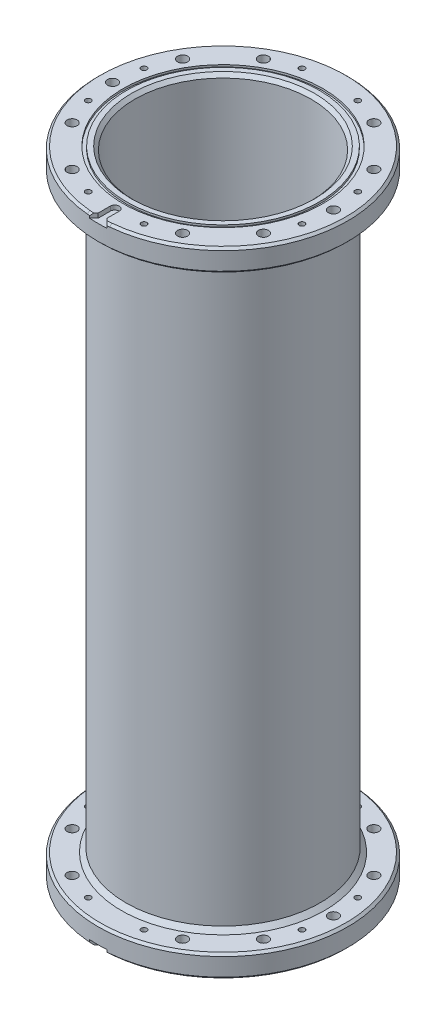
ISO-10303-21;
HEADER;
FILE_DESCRIPTION(('STEP AP214'),'2;1');
FILE_NAME('part.step','',(''),(''),'','','');
FILE_SCHEMA(('AUTOMOTIVE_DESIGN { 1 0 10303 214 1 1 1 1 }'));
ENDSEC;
DATA;
#1=APPLICATION_CONTEXT('core data for automotive mechanical design processes');
#2=APPLICATION_PROTOCOL_DEFINITION('international standard','automotive_design',2000,#1);
#3=PRODUCT_CONTEXT('',#1,'mechanical');
#4=PRODUCT('Part','Part','',(#3));
#5=PRODUCT_RELATED_PRODUCT_CATEGORY('part','',(#4));
#6=PRODUCT_DEFINITION_FORMATION('','',#4);
#7=PRODUCT_DEFINITION_CONTEXT('part definition',#1,'design');
#8=PRODUCT_DEFINITION('design','',#6,#7);
#9=PRODUCT_DEFINITION_SHAPE('','',#8);
#10=(LENGTH_UNIT() NAMED_UNIT(*) SI_UNIT(.MILLI.,.METRE.));
#11=(NAMED_UNIT(*) PLANE_ANGLE_UNIT() SI_UNIT($,.RADIAN.));
#12=(NAMED_UNIT(*) SI_UNIT($,.STERADIAN.) SOLID_ANGLE_UNIT());
#13=UNCERTAINTY_MEASURE_WITH_UNIT(LENGTH_MEASURE(1.E-05),#10,'distance_accuracy_value','');
#14=(GEOMETRIC_REPRESENTATION_CONTEXT(3) GLOBAL_UNCERTAINTY_ASSIGNED_CONTEXT((#13)) GLOBAL_UNIT_ASSIGNED_CONTEXT((#10,
#11,#12)) REPRESENTATION_CONTEXT('',''));
#15=CARTESIAN_POINT('',(0.,0.,0.));
#16=DIRECTION('',(0.,0.,1.));
#17=DIRECTION('',(1.,0.,0.));
#18=AXIS2_PLACEMENT_3D('',#15,#16,#17);
#19=CARTESIAN_POINT('',(0.,-132.,0.));
#20=DIRECTION('',(0.,-1.,0.));
#21=DIRECTION('',(0.,0.,-1.));
#22=AXIS2_PLACEMENT_3D('',#19,#20,#21);
#23=CYLINDRICAL_SURFACE('',#22,56.);
#24=CARTESIAN_POINT('',(0.,-133.,0.));
#25=DIRECTION('',(0.,-1.,0.));
#26=DIRECTION('',(0.,0.,-1.));
#27=AXIS2_PLACEMENT_3D('',#24,#25,#26);
#28=CIRCLE('',#27,56.);
#29=CARTESIAN_POINT('',(0.,-133.,-56.));
#30=VERTEX_POINT('',#29);
#31=EDGE_CURVE('E1065',#30,#30,#28,.T.);
#32=ORIENTED_EDGE('',*,*,#31,.T.);
#33=EDGE_LOOP('',(#32));
#34=FACE_BOUND('',#33,.T.);
#35=CARTESIAN_POINT('',(0.,-137.25,-56.));
#36=CARTESIAN_POINT('',(0.0702036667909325,-137.250003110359,-55.9999998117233));
#37=CARTESIAN_POINT('',(0.140458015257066,-137.255934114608,-55.9998665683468));
#38=CARTESIAN_POINT('',(0.279031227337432,-137.279511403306,-55.9993478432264));
#39=CARTESIAN_POINT('',(0.347347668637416,-137.297171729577,-55.99896205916));
#40=CARTESIAN_POINT('',(0.48001747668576,-137.343704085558,-55.9979819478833));
#41=CARTESIAN_POINT('',(0.544372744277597,-137.372570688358,-55.9973877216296));
#42=CARTESIAN_POINT('',(0.667305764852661,-137.440688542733,-55.9960577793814));
#43=CARTESIAN_POINT('',(0.725884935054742,-137.479937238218,-55.9953220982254));
#44=CARTESIAN_POINT('',(0.835639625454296,-137.56772031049,-55.9937918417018));
#45=CARTESIAN_POINT('',(0.88681321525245,-137.616257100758,-55.9929972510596));
#46=CARTESIAN_POINT('',(0.980288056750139,-137.721234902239,-55.9914388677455));
#47=CARTESIAN_POINT('',(1.02258895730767,-137.77767622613,-55.9906750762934));
#48=CARTESIAN_POINT('',(1.09711871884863,-137.896865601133,-55.9892643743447));
#49=CARTESIAN_POINT('',(1.12934671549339,-137.959614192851,-55.9886174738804));
#50=CARTESIAN_POINT('',(1.18281008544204,-138.089632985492,-55.9875136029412));
#51=CARTESIAN_POINT('',(1.20404549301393,-138.156903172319,-55.9870566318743));
#52=CARTESIAN_POINT('',(1.2349175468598,-138.294043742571,-55.9863842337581));
#53=CARTESIAN_POINT('',(1.24455612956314,-138.36391368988,-55.9861687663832));
#54=CARTESIAN_POINT('',(1.25196688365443,-138.504280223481,-55.986003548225));
#55=CARTESIAN_POINT('',(1.24973909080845,-138.574776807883,-55.9860537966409));
#56=CARTESIAN_POINT('',(1.23348200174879,-138.714382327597,-55.9864143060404));
#57=CARTESIAN_POINT('',(1.21945480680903,-138.783491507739,-55.9867245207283));
#58=CARTESIAN_POINT('',(1.18000033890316,-138.918373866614,-55.9875699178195));
#59=CARTESIAN_POINT('',(1.15457304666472,-138.984147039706,-55.988105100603));
#60=CARTESIAN_POINT('',(1.09303776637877,-139.110497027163,-55.9893401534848));
#61=CARTESIAN_POINT('',(1.05692881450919,-139.171073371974,-55.9900400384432));
#62=CARTESIAN_POINT('',(0.975055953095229,-139.285304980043,-55.9915255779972));
#63=CARTESIAN_POINT('',(0.929292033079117,-139.338960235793,-55.9923112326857));
#64=CARTESIAN_POINT('',(0.829396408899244,-139.437838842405,-55.9938799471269));
#65=CARTESIAN_POINT('',(0.77526288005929,-139.483060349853,-55.9946630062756));
#66=CARTESIAN_POINT('',(0.660171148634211,-139.563773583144,-55.9961380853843));
#67=CARTESIAN_POINT('',(0.59921294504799,-139.59926530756,-55.9968301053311));
#68=CARTESIAN_POINT('',(0.472201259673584,-139.659511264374,-55.9980450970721));
#69=CARTESIAN_POINT('',(0.406147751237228,-139.684265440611,-55.9985680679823));
#70=CARTESIAN_POINT('',(0.270820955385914,-139.722332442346,-55.9993859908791));
#71=CARTESIAN_POINT('',(0.201547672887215,-139.735645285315,-55.9996809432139));
#72=CARTESIAN_POINT('',(0.0617637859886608,-139.750449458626,-56.000009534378));
#73=CARTESIAN_POINT('',(-0.00874654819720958,-139.751943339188,-56.0000432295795));
#74=CARTESIAN_POINT('',(-0.149017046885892,-139.743073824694,-55.9998456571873));
#75=CARTESIAN_POINT('',(-0.218777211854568,-139.732710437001,-55.999614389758));
#76=CARTESIAN_POINT('',(-0.355560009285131,-139.700422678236,-55.9989129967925));
#77=CARTESIAN_POINT('',(-0.422582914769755,-139.678499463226,-55.9984428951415));
#78=CARTESIAN_POINT('',(-0.551997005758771,-139.623715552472,-55.9973168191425));
#79=CARTESIAN_POINT('',(-0.61438818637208,-139.590854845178,-55.9966608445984));
#80=CARTESIAN_POINT('',(-0.732779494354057,-139.515122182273,-55.9952368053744));
#81=CARTESIAN_POINT('',(-0.788778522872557,-139.472248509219,-55.9944687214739));
#82=CARTESIAN_POINT('',(-0.892784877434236,-139.377709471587,-55.9929071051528));
#83=CARTESIAN_POINT('',(-0.940792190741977,-139.326044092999,-55.9921135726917));
#84=CARTESIAN_POINT('',(-1.02746083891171,-139.215377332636,-55.9905903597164));
#85=CARTESIAN_POINT('',(-1.06612052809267,-139.156374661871,-55.9898606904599));
#86=CARTESIAN_POINT('',(-1.13298524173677,-139.032714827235,-55.9885476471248));
#87=CARTESIAN_POINT('',(-1.16119028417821,-138.96805767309,-55.9879642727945));
#88=CARTESIAN_POINT('',(-1.20634219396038,-138.834930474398,-55.98700967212));
#89=CARTESIAN_POINT('',(-1.22329013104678,-138.766460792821,-55.986638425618));
#90=CARTESIAN_POINT('',(-1.24545025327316,-138.627646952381,-55.9861498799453));
#91=CARTESIAN_POINT('',(-1.25066243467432,-138.557302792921,-55.9860325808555));
#92=CARTESIAN_POINT('',(-1.24920294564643,-138.416753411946,-55.9860651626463));
#93=CARTESIAN_POINT('',(-1.24253387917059,-138.346548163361,-55.9862149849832));
#94=CARTESIAN_POINT('',(-1.21750653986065,-138.208253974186,-55.9867647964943));
#95=CARTESIAN_POINT('',(-1.1991482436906,-138.14016503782,-55.9871647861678));
#96=CARTESIAN_POINT('',(-1.15126373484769,-138.008034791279,-55.988169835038));
#97=CARTESIAN_POINT('',(-1.12173732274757,-137.943993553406,-55.9887748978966));
#98=CARTESIAN_POINT('',(-1.05235619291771,-137.821779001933,-55.9901218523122));
#99=CARTESIAN_POINT('',(-1.01250186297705,-137.763605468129,-55.9908637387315));
#100=CARTESIAN_POINT('',(-0.923590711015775,-137.654767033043,-55.9924008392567));
#101=CARTESIAN_POINT('',(-0.874532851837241,-137.604102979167,-55.9931960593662));
#102=CARTESIAN_POINT('',(-0.768593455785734,-137.511716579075,-55.9947503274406));
#103=CARTESIAN_POINT('',(-0.711709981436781,-137.469996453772,-55.9955093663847));
#104=CARTESIAN_POINT('',(-0.591717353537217,-137.396678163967,-55.9969058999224));
#105=CARTESIAN_POINT('',(-0.528604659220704,-137.365085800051,-55.9975433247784));
#106=CARTESIAN_POINT('',(-0.398018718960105,-137.31298200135,-55.9986234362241));
#107=CARTESIAN_POINT('',(-0.330550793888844,-137.292457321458,-55.9990663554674));
#108=CARTESIAN_POINT('',(-0.218879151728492,-137.268524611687,-55.9995888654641));
#109=CARTESIAN_POINT('',(-0.175400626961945,-137.261586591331,-55.9997423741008));
#110=CARTESIAN_POINT('',(-0.0879547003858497,-137.252323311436,-55.9999480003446));
#111=CARTESIAN_POINT('',(-0.0439872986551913,-137.249998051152,-56.000000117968));
#112=CARTESIAN_POINT('',(0.,-137.25,-56.));
#113=B_SPLINE_CURVE_WITH_KNOTS('',3,(#35,#36,#37,#38,#39,#40,#41,#42,#43,#44,#45,#46,#47,#48,
#49,#50,#51,#52,#53,#54,#55,#56,#57,#58,#59,#60,#61,#62,#63,#64,#65,#66,#67,#68,#69,#70,#71,#72,
#73,#74,#75,#76,#77,#78,#79,#80,#81,#82,#83,#84,#85,#86,#87,#88,#89,#90,#91,#92,#93,#94,#95,#96,
#97,#98,#99,#100,#101,#102,#103,#104,#105,#106,#107,#108,#109,#110,#111,#112),.UNSPECIFIED.,.T.,
.F.,(4,2,2,2,2,2,2,2,2,2,2,2,2,2,2,2,2,2,2,2,2,2,2,2,2,2,2,2,2,2,2,2,2,2,2,2,2,2,4),(0.,
0.210450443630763,0.42115328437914,0.631754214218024,0.842303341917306,1.05290725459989,
1.26351950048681,1.47414981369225,1.68477947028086,1.89537395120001,2.10596779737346,
2.31652414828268,2.52708085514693,2.73765656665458,2.9482325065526,3.15885441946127,
3.36947636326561,3.58009940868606,3.79072213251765,4.00129940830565,4.21187655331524,
4.42243264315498,4.63298895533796,4.84358140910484,5.05417419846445,5.26480403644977,
5.47543351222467,5.68604296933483,5.89665249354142,6.10721586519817,6.31777965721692,
6.52834720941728,6.73890685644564,6.94949024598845,7.16012586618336,7.37088191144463,
7.58138517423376,7.71324649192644,7.84510778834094),.UNSPECIFIED.);
#114=CARTESIAN_POINT('',(0.,-137.25,-56.));
#115=VERTEX_POINT('',#114);
#116=EDGE_CURVE('E565',#115,#115,#113,.T.);
#117=ORIENTED_EDGE('',*,*,#116,.F.);
#118=EDGE_LOOP('',(#117));
#119=FACE_BOUND('',#118,.T.);
#120=CARTESIAN_POINT('',(0.,-141.,0.));
#121=DIRECTION('',(0.,-1.,0.));
#122=DIRECTION('',(0.,0.,-1.));
#123=AXIS2_PLACEMENT_3D('',#120,#121,#122);
#124=CIRCLE('',#123,56.);
#125=CARTESIAN_POINT('',(-5.,-141.,55.7763390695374));
#126=VERTEX_POINT('',#125);
#127=CARTESIAN_POINT('',(-3.89977289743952,-141.,55.8640472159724));
#128=VERTEX_POINT('',#127);
#129=EDGE_CURVE('E667',#126,#128,#124,.F.);
#130=ORIENTED_EDGE('',*,*,#129,.T.);
#131=DIRECTION('',(0.,-1.,0.));
#132=VECTOR('',#131,1.);
#133=CARTESIAN_POINT('',(-3.89977289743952,-132.,55.8640472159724));
#134=LINE('',#133,#132);
#135=CARTESIAN_POINT('',(-3.89977289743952,-140.,55.8640472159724));
#136=VERTEX_POINT('',#135);
#137=EDGE_CURVE('E682',#128,#136,#134,.F.);
#138=ORIENTED_EDGE('',*,*,#137,.T.);
#139=CARTESIAN_POINT('',(0.,-140.,0.));
#140=DIRECTION('',(0.,-1.,0.));
#141=DIRECTION('',(0.,0.,-1.));
#142=AXIS2_PLACEMENT_3D('',#139,#140,#141);
#143=CIRCLE('',#142,56.);
#144=CARTESIAN_POINT('',(3.89977289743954,-140.,55.8640472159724));
#145=VERTEX_POINT('',#144);
#146=EDGE_CURVE('E668',#136,#145,#143,.F.);
#147=ORIENTED_EDGE('',*,*,#146,.T.);
#148=DIRECTION('',(0.,-1.,0.));
#149=VECTOR('',#148,1.);
#150=CARTESIAN_POINT('',(3.89977289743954,-132.,55.8640472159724));
#151=LINE('',#150,#149);
#152=CARTESIAN_POINT('',(3.89977289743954,-141.,55.8640472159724));
#153=VERTEX_POINT('',#152);
#154=EDGE_CURVE('E680',#145,#153,#151,.T.);
#155=ORIENTED_EDGE('',*,*,#154,.T.);
#156=CARTESIAN_POINT('',(0.,-141.,0.));
#157=DIRECTION('',(0.,-1.,0.));
#158=DIRECTION('',(0.,0.,-1.));
#159=AXIS2_PLACEMENT_3D('',#156,#157,#158);
#160=CIRCLE('',#159,56.);
#161=CARTESIAN_POINT('',(5.,-141.,55.7763390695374));
#162=VERTEX_POINT('',#161);
#163=EDGE_CURVE('E662',#153,#162,#160,.F.);
#164=ORIENTED_EDGE('',*,*,#163,.T.);
#165=CARTESIAN_POINT('',(0.,-141.,0.));
#166=DIRECTION('',(0.,-1.,0.));
#167=DIRECTION('',(0.,0.,-1.));
#168=AXIS2_PLACEMENT_3D('',#165,#166,#167);
#169=CIRCLE('',#168,56.);
#170=EDGE_CURVE('E477',#162,#126,#169,.F.);
#171=ORIENTED_EDGE('',*,*,#170,.T.);
#172=EDGE_LOOP('',(#130,#138,#147,#155,#164,#171));
#173=FACE_BOUND('',#172,.T.);
#174=ADVANCED_FACE('F46',(#34,#119,#173),#23,.T.);
#175=CARTESIAN_POINT('',(0.,-142.,0.));
#176=DIRECTION('',(0.,-1.,0.));
#177=DIRECTION('',(0.,0.,-1.));
#178=AXIS2_PLACEMENT_3D('',#175,#176,#177);
#179=PLANE('',#178);
#180=CARTESIAN_POINT('',(-47.8957200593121,-142.,-12.5000000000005));
#181=DIRECTION('',(0.,-1.,0.));
#182=DIRECTION('',(-1.,0.,0.));
#183=AXIS2_PLACEMENT_3D('',#180,#181,#182);
#184=CIRCLE('',#183,1.24999999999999);
#185=CARTESIAN_POINT('',(-49.1457200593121,-142.,-12.5000000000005));
#186=VERTEX_POINT('',#185);
#187=EDGE_CURVE('E349',#186,#186,#184,.T.);
#188=ORIENTED_EDGE('',*,*,#187,.F.);
#189=EDGE_LOOP('',(#188));
#190=FACE_BOUND('',#189,.T.);
#191=CARTESIAN_POINT('',(47.8957200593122,-142.,12.5000000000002));
#192=DIRECTION('',(0.,-1.,0.));
#193=DIRECTION('',(1.,0.,0.));
#194=AXIS2_PLACEMENT_3D('',#191,#192,#193);
#195=CIRCLE('',#194,1.24999999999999);
#196=CARTESIAN_POINT('',(49.1457200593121,-142.,12.5000000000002));
#197=VERTEX_POINT('',#196);
#198=EDGE_CURVE('E357',#197,#197,#195,.T.);
#199=ORIENTED_EDGE('',*,*,#198,.F.);
#200=EDGE_LOOP('',(#199));
#201=FACE_BOUND('',#200,.T.);
#202=CARTESIAN_POINT('',(47.8957200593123,-142.,-12.4999999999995));
#203=DIRECTION('',(0.,-1.,0.));
#204=DIRECTION('',(-1.,0.,0.));
#205=AXIS2_PLACEMENT_3D('',#202,#203,#204);
#206=CIRCLE('',#205,1.24999999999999);
#207=CARTESIAN_POINT('',(46.6457200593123,-142.,-12.4999999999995));
#208=VERTEX_POINT('',#207);
#209=EDGE_CURVE('E363',#208,#208,#206,.T.);
#210=ORIENTED_EDGE('',*,*,#209,.F.);
#211=EDGE_LOOP('',(#210));
#212=FACE_BOUND('',#211,.T.);
#213=CARTESIAN_POINT('',(-47.8957200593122,-142.,12.4999999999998));
#214=DIRECTION('',(0.,-1.,0.));
#215=DIRECTION('',(1.,0.,0.));
#216=AXIS2_PLACEMENT_3D('',#213,#214,#215);
#217=CIRCLE('',#216,1.24999999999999);
#218=CARTESIAN_POINT('',(-46.6457200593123,-142.,12.4999999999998));
#219=VERTEX_POINT('',#218);
#220=EDGE_CURVE('E369',#219,#219,#217,.T.);
#221=ORIENTED_EDGE('',*,*,#220,.F.);
#222=EDGE_LOOP('',(#221));
#223=FACE_BOUND('',#222,.T.);
#224=CARTESIAN_POINT('',(12.5,-142.,47.8957200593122));
#225=DIRECTION('',(0.,-1.,0.));
#226=DIRECTION('',(0.,0.,-1.));
#227=AXIS2_PLACEMENT_3D('',#224,#225,#226);
#228=CIRCLE('',#227,1.24999999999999);
#229=CARTESIAN_POINT('',(12.5,-142.,46.6457200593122));
#230=VERTEX_POINT('',#229);
#231=EDGE_CURVE('E375',#230,#230,#228,.T.);
#232=ORIENTED_EDGE('',*,*,#231,.F.);
#233=EDGE_LOOP('',(#232));
#234=FACE_BOUND('',#233,.T.);
#235=CARTESIAN_POINT('',(-12.5,-142.,47.8957200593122));
#236=DIRECTION('',(0.,-1.,0.));
#237=DIRECTION('',(0.,0.,-1.));
#238=AXIS2_PLACEMENT_3D('',#235,#236,#237);
#239=CIRCLE('',#238,1.24999999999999);
#240=CARTESIAN_POINT('',(-12.5,-142.,46.6457200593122));
#241=VERTEX_POINT('',#240);
#242=EDGE_CURVE('E381',#241,#241,#239,.T.);
#243=ORIENTED_EDGE('',*,*,#242,.F.);
#244=EDGE_LOOP('',(#243));
#245=FACE_BOUND('',#244,.T.);
#246=CARTESIAN_POINT('',(12.5,-142.,-47.8957200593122));
#247=DIRECTION('',(0.,-1.,0.));
#248=DIRECTION('',(0.,0.,-1.));
#249=AXIS2_PLACEMENT_3D('',#246,#247,#248);
#250=CIRCLE('',#249,1.24999999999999);
#251=CARTESIAN_POINT('',(12.5,-142.,-49.1457200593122));
#252=VERTEX_POINT('',#251);
#253=EDGE_CURVE('E387',#252,#252,#250,.T.);
#254=ORIENTED_EDGE('',*,*,#253,.F.);
#255=EDGE_LOOP('',(#254));
#256=FACE_BOUND('',#255,.T.);
#257=CARTESIAN_POINT('',(-12.5,-142.,-47.8957200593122));
#258=DIRECTION('',(0.,-1.,0.));
#259=DIRECTION('',(0.,0.,-1.));
#260=AXIS2_PLACEMENT_3D('',#257,#258,#259);
#261=CIRCLE('',#260,1.24999999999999);
#262=CARTESIAN_POINT('',(-12.5,-142.,-49.1457200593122));
#263=VERTEX_POINT('',#262);
#264=EDGE_CURVE('E393',#263,#263,#261,.T.);
#265=ORIENTED_EDGE('',*,*,#264,.F.);
#266=EDGE_LOOP('',(#265));
#267=FACE_BOUND('',#266,.T.);
#268=CARTESIAN_POINT('',(0.,-142.,0.));
#269=DIRECTION('',(0.,-1.,0.));
#270=DIRECTION('',(0.,0.,-1.));
#271=AXIS2_PLACEMENT_3D('',#268,#269,#270);
#272=CIRCLE('',#271,44.75);
#273=CARTESIAN_POINT('',(0.,-142.,-44.75));
#274=VERTEX_POINT('',#273);
#275=EDGE_CURVE('E406',#274,#274,#272,.T.);
#276=ORIENTED_EDGE('',*,*,#275,.F.);
#277=EDGE_LOOP('',(#276));
#278=FACE_BOUND('',#277,.T.);
#279=CARTESIAN_POINT('',(42.86825748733,-142.,-24.7499999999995));
#280=DIRECTION('',(0.,-1.,0.));
#281=DIRECTION('',(-0.499999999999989,0.,-0.866025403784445));
#282=AXIS2_PLACEMENT_3D('',#279,#280,#281);
#283=CIRCLE('',#282,2.25);
#284=CARTESIAN_POINT('',(41.7432574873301,-142.,-26.6985571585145));
#285=VERTEX_POINT('',#284);
#286=EDGE_CURVE('E412',#285,#285,#283,.T.);
#287=ORIENTED_EDGE('',*,*,#286,.F.);
#288=EDGE_LOOP('',(#287));
#289=FACE_BOUND('',#288,.T.);
#290=CARTESIAN_POINT('',(24.7500000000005,-142.,-42.8682574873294));
#291=DIRECTION('',(0.,-1.,0.));
#292=DIRECTION('',(-0.866025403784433,0.,-0.50000000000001));
#293=AXIS2_PLACEMENT_3D('',#290,#291,#292);
#294=CIRCLE('',#293,2.25);
#295=CARTESIAN_POINT('',(22.8014428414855,-142.,-43.9932574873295));
#296=VERTEX_POINT('',#295);
#297=EDGE_CURVE('E418',#296,#296,#294,.T.);
#298=ORIENTED_EDGE('',*,*,#297,.F.);
#299=EDGE_LOOP('',(#298));
#300=FACE_BOUND('',#299,.T.);
#301=CARTESIAN_POINT('',(-24.7499999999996,-142.,-42.8682574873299));
#302=DIRECTION('',(0.,-1.,0.));
#303=DIRECTION('',(-0.866025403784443,0.,0.499999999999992));
#304=AXIS2_PLACEMENT_3D('',#301,#302,#303);
#305=CIRCLE('',#304,2.25);
#306=CARTESIAN_POINT('',(-26.6985571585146,-142.,-41.74325748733));
#307=VERTEX_POINT('',#306);
#308=EDGE_CURVE('E424',#307,#307,#305,.T.);
#309=ORIENTED_EDGE('',*,*,#308,.F.);
#310=EDGE_LOOP('',(#309));
#311=FACE_BOUND('',#310,.T.);
#312=CARTESIAN_POINT('',(-42.8682574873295,-142.,-24.7500000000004));
#313=DIRECTION('',(0.,-1.,0.));
#314=DIRECTION('',(-0.500000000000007,0.,0.866025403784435));
#315=AXIS2_PLACEMENT_3D('',#312,#313,#314);
#316=CIRCLE('',#315,2.25);
#317=CARTESIAN_POINT('',(-43.9932574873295,-142.,-22.8014428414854));
#318=VERTEX_POINT('',#317);
#319=EDGE_CURVE('E430',#318,#318,#316,.T.);
#320=ORIENTED_EDGE('',*,*,#319,.F.);
#321=EDGE_LOOP('',(#320));
#322=FACE_BOUND('',#321,.T.);
#323=CARTESIAN_POINT('',(-49.5,-142.,0.));
#324=DIRECTION('',(0.,-1.,0.));
#325=DIRECTION('',(0.,0.,1.));
#326=AXIS2_PLACEMENT_3D('',#323,#324,#325);
#327=CIRCLE('',#326,2.25);
#328=CARTESIAN_POINT('',(-49.5,-142.,2.25));
#329=VERTEX_POINT('',#328);
#330=EDGE_CURVE('E436',#329,#329,#327,.T.);
#331=ORIENTED_EDGE('',*,*,#330,.F.);
#332=EDGE_LOOP('',(#331));
#333=FACE_BOUND('',#332,.T.);
#334=CARTESIAN_POINT('',(-42.8682574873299,-142.,24.7499999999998));
#335=DIRECTION('',(0.,-1.,0.));
#336=DIRECTION('',(0.499999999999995,0.,0.866025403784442));
#337=AXIS2_PLACEMENT_3D('',#334,#335,#336);
#338=CIRCLE('',#337,2.25);
#339=CARTESIAN_POINT('',(-41.7432574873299,-142.,26.6985571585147));
#340=VERTEX_POINT('',#339);
#341=EDGE_CURVE('E442',#340,#340,#338,.T.);
#342=ORIENTED_EDGE('',*,*,#341,.F.);
#343=EDGE_LOOP('',(#342));
#344=FACE_BOUND('',#343,.T.);
#345=CARTESIAN_POINT('',(-24.7500000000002,-142.,42.8682574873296));
#346=DIRECTION('',(0.,-1.,0.));
#347=DIRECTION('',(0.866025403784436,0.,0.500000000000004));
#348=AXIS2_PLACEMENT_3D('',#345,#346,#347);
#349=CIRCLE('',#348,2.25);
#350=CARTESIAN_POINT('',(-22.8014428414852,-142.,43.9932574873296));
#351=VERTEX_POINT('',#350);
#352=EDGE_CURVE('E448',#351,#351,#349,.T.);
#353=ORIENTED_EDGE('',*,*,#352,.F.);
#354=EDGE_LOOP('',(#353));
#355=FACE_BOUND('',#354,.T.);
#356=CARTESIAN_POINT('',(24.7499999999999,-142.,42.8682574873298));
#357=DIRECTION('',(0.,-1.,0.));
#358=DIRECTION('',(0.86602540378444,0.,-0.499999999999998));
#359=AXIS2_PLACEMENT_3D('',#356,#357,#358);
#360=CIRCLE('',#359,2.25);
#361=CARTESIAN_POINT('',(26.6985571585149,-142.,41.7432574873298));
#362=VERTEX_POINT('',#361);
#363=EDGE_CURVE('E454',#362,#362,#360,.T.);
#364=ORIENTED_EDGE('',*,*,#363,.F.);
#365=EDGE_LOOP('',(#364));
#366=FACE_BOUND('',#365,.T.);
#367=CARTESIAN_POINT('',(42.8682574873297,-142.,24.75));
#368=DIRECTION('',(0.,-1.,0.));
#369=DIRECTION('',(0.500000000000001,0.,-0.866025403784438));
#370=AXIS2_PLACEMENT_3D('',#367,#368,#369);
#371=CIRCLE('',#370,2.25);
#372=CARTESIAN_POINT('',(43.9932574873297,-142.,22.8014428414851));
#373=VERTEX_POINT('',#372);
#374=EDGE_CURVE('E460',#373,#373,#371,.T.);
#375=ORIENTED_EDGE('',*,*,#374,.F.);
#376=EDGE_LOOP('',(#375));
#377=FACE_BOUND('',#376,.T.);
#378=CARTESIAN_POINT('',(49.5,-142.,0.));
#379=DIRECTION('',(0.,-1.,0.));
#380=DIRECTION('',(0.,0.,-1.));
#381=AXIS2_PLACEMENT_3D('',#378,#379,#380);
#382=CIRCLE('',#381,2.25);
#383=CARTESIAN_POINT('',(49.5,-142.,-2.25));
#384=VERTEX_POINT('',#383);
#385=EDGE_CURVE('E466',#384,#384,#382,.T.);
#386=ORIENTED_EDGE('',*,*,#385,.F.);
#387=EDGE_LOOP('',(#386));
#388=FACE_BOUND('',#387,.T.);
#389=DIRECTION('',(0.,0.,1.));
#390=VECTOR('',#389,1.);
#391=CARTESIAN_POINT('',(-2.,-142.,48.5));
#392=LINE('',#391,#390);
#393=CARTESIAN_POINT('',(-2.,-142.,48.5));
#394=VERTEX_POINT('',#393);
#395=CARTESIAN_POINT('',(-2.,-142.,53.9642743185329));
#396=VERTEX_POINT('',#395);
#397=EDGE_CURVE('E199',#394,#396,#392,.T.);
#398=ORIENTED_EDGE('',*,*,#397,.T.);
#399=DIRECTION('',(-0.707106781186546,0.,0.707106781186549));
#400=VECTOR('',#399,1.);
#401=CARTESIAN_POINT('',(25.9821371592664,-142.,25.9821371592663));
#402=LINE('',#401,#400);
#403=CARTESIAN_POINT('',(-2.95622057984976,-142.,54.9204948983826));
#404=VERTEX_POINT('',#403);
#405=EDGE_CURVE('E622',#396,#404,#402,.T.);
#406=ORIENTED_EDGE('',*,*,#405,.T.);
#407=CARTESIAN_POINT('',(0.,-142.,0.));
#408=DIRECTION('',(0.,-1.,0.));
#409=DIRECTION('',(0.,0.,-1.));
#410=AXIS2_PLACEMENT_3D('',#407,#408,#409);
#411=CIRCLE('',#410,55.);
#412=CARTESIAN_POINT('',(-5.,-142.,54.7722557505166));
#413=VERTEX_POINT('',#412);
#414=EDGE_CURVE('E678',#404,#413,#411,.T.);
#415=ORIENTED_EDGE('',*,*,#414,.T.);
#416=CARTESIAN_POINT('',(0.,-142.,0.));
#417=DIRECTION('',(0.,-1.,0.));
#418=DIRECTION('',(0.,0.,-1.));
#419=AXIS2_PLACEMENT_3D('',#416,#417,#418);
#420=CIRCLE('',#419,55.);
#421=CARTESIAN_POINT('',(5.,-142.,54.7722557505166));
#422=VERTEX_POINT('',#421);
#423=EDGE_CURVE('E472',#413,#422,#420,.T.);
#424=ORIENTED_EDGE('',*,*,#423,.T.);
#425=CARTESIAN_POINT('',(0.,-142.,0.));
#426=DIRECTION('',(0.,-1.,0.));
#427=DIRECTION('',(0.,0.,-1.));
#428=AXIS2_PLACEMENT_3D('',#425,#426,#427);
#429=CIRCLE('',#428,55.);
#430=CARTESIAN_POINT('',(2.95622057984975,-142.,54.9204948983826));
#431=VERTEX_POINT('',#430);
#432=EDGE_CURVE('E671',#422,#431,#429,.T.);
#433=ORIENTED_EDGE('',*,*,#432,.T.);
#434=DIRECTION('',(0.707106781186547,0.,0.707106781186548));
#435=VECTOR('',#434,1.);
#436=CARTESIAN_POINT('',(-25.9821371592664,-142.,25.9821371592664));
#437=LINE('',#436,#435);
#438=CARTESIAN_POINT('',(2.,-142.,53.9642743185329));
#439=VERTEX_POINT('',#438);
#440=EDGE_CURVE('E70',#431,#439,#437,.F.);
#441=ORIENTED_EDGE('',*,*,#440,.T.);
#442=DIRECTION('',(0.,0.,-1.));
#443=VECTOR('',#442,1.);
#444=CARTESIAN_POINT('',(1.99999999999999,-142.,0.));
#445=LINE('',#444,#443);
#446=CARTESIAN_POINT('',(2.,-142.,48.5));
#447=VERTEX_POINT('',#446);
#448=EDGE_CURVE('E673',#439,#447,#445,.T.);
#449=ORIENTED_EDGE('',*,*,#448,.T.);
#450=CARTESIAN_POINT('',(0.,-142.,48.5));
#451=DIRECTION('',(0.,1.,0.));
#452=DIRECTION('',(0.,0.,1.));
#453=AXIS2_PLACEMENT_3D('',#450,#451,#452);
#454=CIRCLE('',#453,2.);
#455=EDGE_CURVE('E194',#447,#394,#454,.T.);
#456=ORIENTED_EDGE('',*,*,#455,.T.);
#457=EDGE_LOOP('',(#398,#406,#415,#424,#433,#441,#449,#456));
#458=FACE_BOUND('',#457,.T.);
#459=ADVANCED_FACE('F551',(#190,#201,#212,#223,#234,#245,#256,#267,#278,#289,#300,#311,#322,
#333,#344,#355,#366,#377,#388,#458),#179,.T.);
#460=CARTESIAN_POINT('',(0.,142.,0.));
#461=DIRECTION('',(0.,-1.,0.));
#462=DIRECTION('',(0.,0.,-1.));
#463=AXIS2_PLACEMENT_3D('',#460,#461,#462);
#464=CONICAL_SURFACE('',#463,55.,0.785398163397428);
#465=CARTESIAN_POINT('',(0.,142.,0.));
#466=DIRECTION('',(0.,1.,0.));
#467=DIRECTION('',(0.,0.,1.));
#468=AXIS2_PLACEMENT_3D('',#465,#466,#467);
#469=CIRCLE('',#468,55.);
#470=CARTESIAN_POINT('',(2.9562205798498,142.,54.9204948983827));
#471=VERTEX_POINT('',#470);
#472=CARTESIAN_POINT('',(5.,142.,54.7722557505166));
#473=VERTEX_POINT('',#472);
#474=EDGE_CURVE('E1064',#471,#473,#469,.T.);
#475=ORIENTED_EDGE('',*,*,#474,.F.);
#476=CARTESIAN_POINT('',(2.9562205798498,142.,54.9204948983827));
#477=CARTESIAN_POINT('',(3.11387702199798,141.834083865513,55.0781513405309));
#478=CARTESIAN_POINT('',(3.27133460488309,141.667792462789,55.235608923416));
#479=CARTESIAN_POINT('',(3.58585204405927,141.334459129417,55.5501263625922));
#480=CARTESIAN_POINT('',(3.74291190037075,141.167417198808,55.7071862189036));
#481=CARTESIAN_POINT('',(3.89977289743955,141.,55.8640472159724));
#482=B_SPLINE_CURVE_WITH_KNOTS('',3,(#476,#477,#478,#479,#480,#481),.UNSPECIFIED.,.F.,.F.,(4,2,
4),(0.,0.833755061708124,1.66751008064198),.UNSPECIFIED.);
#483=CARTESIAN_POINT('',(3.89977289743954,141.,55.8640472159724));
#484=VERTEX_POINT('',#483);
#485=EDGE_CURVE('E1013',#471,#484,#482,.T.);
#486=ORIENTED_EDGE('',*,*,#485,.T.);
#487=CARTESIAN_POINT('',(0.,141.,0.));
#488=DIRECTION('',(0.,1.,0.));
#489=DIRECTION('',(0.,0.,1.));
#490=AXIS2_PLACEMENT_3D('',#487,#488,#489);
#491=CIRCLE('',#490,56.);
#492=CARTESIAN_POINT('',(5.,141.,55.7763390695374));
#493=VERTEX_POINT('',#492);
#494=EDGE_CURVE('E1004',#493,#484,#491,.F.);
#495=ORIENTED_EDGE('',*,*,#494,.F.);
#496=CARTESIAN_POINT('',(5.,147.389937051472,49.3574548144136));
#497=CARTESIAN_POINT('',(5.,146.473043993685,50.279037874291));
#498=CARTESIAN_POINT('',(5.,145.556022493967,51.2004931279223));
#499=CARTESIAN_POINT('',(5.,143.721756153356,53.0431812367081));
#500=CARTESIAN_POINT('',(5.,142.804511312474,53.9644140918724));
#501=CARTESIAN_POINT('',(5.,140.969831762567,55.8066906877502));
#502=CARTESIAN_POINT('',(5.,140.052397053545,56.7277344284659));
#503=CARTESIAN_POINT('',(5.,138.217362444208,58.5696574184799));
#504=CARTESIAN_POINT('',(5.,137.299762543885,59.490536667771));
#505=CARTESIAN_POINT('',(5.,136.382092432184,60.4113459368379));
#506=B_SPLINE_CURVE_WITH_KNOTS('',3,(#496,#497,#498,#499,#500,#501,#502,#503,#504,#505),
.UNSPECIFIED.,.F.,.F.,(4,2,2,2,4),(0.,3.90000944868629,7.80001872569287,11.7000279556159,
15.6000373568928),.UNSPECIFIED.);
#507=EDGE_CURVE('E858',#473,#493,#506,.T.);
#508=ORIENTED_EDGE('',*,*,#507,.F.);
#509=EDGE_LOOP('',(#475,#486,#495,#508));
#510=FACE_BOUND('',#509,.T.);
#511=ADVANCED_FACE('F554',(#510),#464,.T.);
#512=CARTESIAN_POINT('',(0.,142.,0.));
#513=DIRECTION('',(0.,1.,0.));
#514=DIRECTION('',(0.,0.,-1.));
#515=AXIS2_PLACEMENT_3D('',#512,#513,#514);
#516=PLANE('',#515);
#517=DIRECTION('',(0.,0.,-1.));
#518=VECTOR('',#517,1.);
#519=CARTESIAN_POINT('',(2.,142.,48.5));
#520=LINE('',#519,#518);
#521=CARTESIAN_POINT('',(2.,142.,53.9642743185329));
#522=VERTEX_POINT('',#521);
#523=CARTESIAN_POINT('',(2.,142.,48.5));
#524=VERTEX_POINT('',#523);
#525=EDGE_CURVE('E212',#522,#524,#520,.T.);
#526=ORIENTED_EDGE('',*,*,#525,.F.);
#527=DIRECTION('',(0.707106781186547,0.,0.707106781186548));
#528=VECTOR('',#527,1.);
#529=CARTESIAN_POINT('',(-25.9821371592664,142.,25.9821371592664));
#530=LINE('',#529,#528);
#531=EDGE_CURVE('E1029',#522,#471,#530,.T.);
#532=ORIENTED_EDGE('',*,*,#531,.T.);
#533=ORIENTED_EDGE('',*,*,#474,.T.);
#534=CARTESIAN_POINT('',(0.,142.,0.));
#535=DIRECTION('',(0.,1.,0.));
#536=DIRECTION('',(0.,0.,1.));
#537=AXIS2_PLACEMENT_3D('',#534,#535,#536);
#538=CIRCLE('',#537,55.);
#539=CARTESIAN_POINT('',(-5.,142.,54.7722557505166));
#540=VERTEX_POINT('',#539);
#541=EDGE_CURVE('E993',#473,#540,#538,.T.);
#542=ORIENTED_EDGE('',*,*,#541,.T.);
#543=CARTESIAN_POINT('',(-2.95622057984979,142.,54.9204948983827));
#544=VERTEX_POINT('',#543);
#545=EDGE_CURVE('E1018',#540,#544,#469,.T.);
#546=ORIENTED_EDGE('',*,*,#545,.T.);
#547=DIRECTION('',(-0.707106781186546,0.,0.707106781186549));
#548=VECTOR('',#547,1.);
#549=CARTESIAN_POINT('',(25.9821371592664,142.,25.9821371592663));
#550=LINE('',#549,#548);
#551=CARTESIAN_POINT('',(-2.,142.,53.9642743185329));
#552=VERTEX_POINT('',#551);
#553=EDGE_CURVE('E1027',#544,#552,#550,.F.);
#554=ORIENTED_EDGE('',*,*,#553,.T.);
#555=DIRECTION('',(0.,0.,1.));
#556=VECTOR('',#555,1.);
#557=CARTESIAN_POINT('',(-2.,142.,48.5));
#558=LINE('',#557,#556);
#559=CARTESIAN_POINT('',(-2.,142.,48.5));
#560=VERTEX_POINT('',#559);
#561=EDGE_CURVE('E220',#560,#552,#558,.T.);
#562=ORIENTED_EDGE('',*,*,#561,.F.);
#563=CARTESIAN_POINT('',(0.,142.,48.5));
#564=DIRECTION('',(0.,1.,0.));
#565=DIRECTION('',(0.,0.,1.));
#566=AXIS2_PLACEMENT_3D('',#563,#564,#565);
#567=CIRCLE('',#566,2.);
#568=EDGE_CURVE('E206',#524,#560,#567,.T.);
#569=ORIENTED_EDGE('',*,*,#568,.F.);
#570=EDGE_LOOP('',(#526,#532,#533,#542,#546,#554,#562,#569));
#571=FACE_BOUND('',#570,.T.);
#572=CARTESIAN_POINT('',(-47.8957200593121,142.,-12.5000000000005));
#573=DIRECTION('',(0.,-1.,0.));
#574=DIRECTION('',(-1.,0.,0.));
#575=AXIS2_PLACEMENT_3D('',#572,#573,#574);
#576=CIRCLE('',#575,1.24999999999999);
#577=CARTESIAN_POINT('',(-49.1457200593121,142.,-12.5000000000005));
#578=VERTEX_POINT('',#577);
#579=EDGE_CURVE('E227',#578,#578,#576,.T.);
#580=ORIENTED_EDGE('',*,*,#579,.T.);
#581=EDGE_LOOP('',(#580));
#582=FACE_BOUND('',#581,.T.);
#583=CARTESIAN_POINT('',(47.8957200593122,142.,12.5000000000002));
#584=DIRECTION('',(0.,-1.,0.));
#585=DIRECTION('',(1.,0.,0.));
#586=AXIS2_PLACEMENT_3D('',#583,#584,#585);
#587=CIRCLE('',#586,1.24999999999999);
#588=CARTESIAN_POINT('',(49.1457200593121,142.,12.5000000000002));
#589=VERTEX_POINT('',#588);
#590=EDGE_CURVE('E234',#589,#589,#587,.T.);
#591=ORIENTED_EDGE('',*,*,#590,.T.);
#592=EDGE_LOOP('',(#591));
#593=FACE_BOUND('',#592,.T.);
#594=CARTESIAN_POINT('',(47.8957200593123,142.,-12.4999999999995));
#595=DIRECTION('',(0.,-1.,0.));
#596=DIRECTION('',(-1.,0.,0.));
#597=AXIS2_PLACEMENT_3D('',#594,#595,#596);
#598=CIRCLE('',#597,1.24999999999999);
#599=CARTESIAN_POINT('',(46.6457200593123,142.,-12.4999999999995));
#600=VERTEX_POINT('',#599);
#601=EDGE_CURVE('E240',#600,#600,#598,.T.);
#602=ORIENTED_EDGE('',*,*,#601,.T.);
#603=EDGE_LOOP('',(#602));
#604=FACE_BOUND('',#603,.T.);
#605=CARTESIAN_POINT('',(-47.8957200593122,142.,12.4999999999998));
#606=DIRECTION('',(0.,-1.,0.));
#607=DIRECTION('',(1.,0.,0.));
#608=AXIS2_PLACEMENT_3D('',#605,#606,#607);
#609=CIRCLE('',#608,1.24999999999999);
#610=CARTESIAN_POINT('',(-46.6457200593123,142.,12.4999999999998));
#611=VERTEX_POINT('',#610);
#612=EDGE_CURVE('E246',#611,#611,#609,.T.);
#613=ORIENTED_EDGE('',*,*,#612,.T.);
#614=EDGE_LOOP('',(#613));
#615=FACE_BOUND('',#614,.T.);
#616=CARTESIAN_POINT('',(12.5,142.,47.8957200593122));
#617=DIRECTION('',(0.,1.,0.));
#618=DIRECTION('',(0.,0.,1.));
#619=AXIS2_PLACEMENT_3D('',#616,#617,#618);
#620=CIRCLE('',#619,1.24999999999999);
#621=CARTESIAN_POINT('',(12.5,142.,49.1457200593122));
#622=VERTEX_POINT('',#621);
#623=EDGE_CURVE('E252',#622,#622,#620,.T.);
#624=ORIENTED_EDGE('',*,*,#623,.F.);
#625=EDGE_LOOP('',(#624));
#626=FACE_BOUND('',#625,.T.);
#627=CARTESIAN_POINT('',(-12.5,142.,47.8957200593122));
#628=DIRECTION('',(0.,1.,0.));
#629=DIRECTION('',(0.,0.,1.));
#630=AXIS2_PLACEMENT_3D('',#627,#628,#629);
#631=CIRCLE('',#630,1.24999999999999);
#632=CARTESIAN_POINT('',(-12.5,142.,49.1457200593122));
#633=VERTEX_POINT('',#632);
#634=EDGE_CURVE('E258',#633,#633,#631,.T.);
#635=ORIENTED_EDGE('',*,*,#634,.F.);
#636=EDGE_LOOP('',(#635));
#637=FACE_BOUND('',#636,.T.);
#638=CARTESIAN_POINT('',(12.5,142.,-47.8957200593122));
#639=DIRECTION('',(0.,1.,0.));
#640=DIRECTION('',(0.,0.,1.));
#641=AXIS2_PLACEMENT_3D('',#638,#639,#640);
#642=CIRCLE('',#641,1.24999999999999);
#643=CARTESIAN_POINT('',(12.5,142.,-46.6457200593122));
#644=VERTEX_POINT('',#643);
#645=EDGE_CURVE('E264',#644,#644,#642,.T.);
#646=ORIENTED_EDGE('',*,*,#645,.F.);
#647=EDGE_LOOP('',(#646));
#648=FACE_BOUND('',#647,.T.);
#649=CARTESIAN_POINT('',(-12.5,142.,-47.8957200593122));
#650=DIRECTION('',(0.,1.,0.));
#651=DIRECTION('',(0.,0.,1.));
#652=AXIS2_PLACEMENT_3D('',#649,#650,#651);
#653=CIRCLE('',#652,1.24999999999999);
#654=CARTESIAN_POINT('',(-12.5,142.,-46.6457200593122));
#655=VERTEX_POINT('',#654);
#656=EDGE_CURVE('E270',#655,#655,#653,.T.);
#657=ORIENTED_EDGE('',*,*,#656,.F.);
#658=EDGE_LOOP('',(#657));
#659=FACE_BOUND('',#658,.T.);
#660=CARTESIAN_POINT('',(42.86825748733,142.,-24.7499999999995));
#661=DIRECTION('',(0.,-1.,0.));
#662=DIRECTION('',(-0.499999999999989,0.,-0.866025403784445));
#663=AXIS2_PLACEMENT_3D('',#660,#661,#662);
#664=CIRCLE('',#663,2.25);
#665=CARTESIAN_POINT('',(41.7432574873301,142.,-26.6985571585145));
#666=VERTEX_POINT('',#665);
#667=EDGE_CURVE('E289',#666,#666,#664,.T.);
#668=ORIENTED_EDGE('',*,*,#667,.T.);
#669=EDGE_LOOP('',(#668));
#670=FACE_BOUND('',#669,.T.);
#671=CARTESIAN_POINT('',(-24.7499999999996,142.,-42.8682574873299));
#672=DIRECTION('',(0.,-1.,0.));
#673=DIRECTION('',(-0.866025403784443,0.,0.499999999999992));
#674=AXIS2_PLACEMENT_3D('',#671,#672,#673);
#675=CIRCLE('',#674,2.25);
#676=CARTESIAN_POINT('',(-26.6985571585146,142.,-41.74325748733));
#677=VERTEX_POINT('',#676);
#678=EDGE_CURVE('E301',#677,#677,#675,.T.);
#679=ORIENTED_EDGE('',*,*,#678,.T.);
#680=EDGE_LOOP('',(#679));
#681=FACE_BOUND('',#680,.T.);
#682=CARTESIAN_POINT('',(-49.5,142.,0.));
#683=DIRECTION('',(0.,-1.,0.));
#684=DIRECTION('',(0.,0.,1.));
#685=AXIS2_PLACEMENT_3D('',#682,#683,#684);
#686=CIRCLE('',#685,2.25);
#687=CARTESIAN_POINT('',(-49.5,142.,2.25));
#688=VERTEX_POINT('',#687);
#689=EDGE_CURVE('E313',#688,#688,#686,.T.);
#690=ORIENTED_EDGE('',*,*,#689,.T.);
#691=EDGE_LOOP('',(#690));
#692=FACE_BOUND('',#691,.T.);
#693=CARTESIAN_POINT('',(-24.7500000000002,142.,42.8682574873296));
#694=DIRECTION('',(0.,-1.,0.));
#695=DIRECTION('',(0.866025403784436,0.,0.500000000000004));
#696=AXIS2_PLACEMENT_3D('',#693,#694,#695);
#697=CIRCLE('',#696,2.25);
#698=CARTESIAN_POINT('',(-22.8014428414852,142.,43.9932574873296));
#699=VERTEX_POINT('',#698);
#700=EDGE_CURVE('E325',#699,#699,#697,.T.);
#701=ORIENTED_EDGE('',*,*,#700,.T.);
#702=EDGE_LOOP('',(#701));
#703=FACE_BOUND('',#702,.T.);
#704=CARTESIAN_POINT('',(42.8682574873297,142.,24.75));
#705=DIRECTION('',(0.,-1.,0.));
#706=DIRECTION('',(0.500000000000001,0.,-0.866025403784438));
#707=AXIS2_PLACEMENT_3D('',#704,#705,#706);
#708=CIRCLE('',#707,2.25);
#709=CARTESIAN_POINT('',(43.9932574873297,142.,22.8014428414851));
#710=VERTEX_POINT('',#709);
#711=EDGE_CURVE('E337',#710,#710,#708,.T.);
#712=ORIENTED_EDGE('',*,*,#711,.T.);
#713=EDGE_LOOP('',(#712));
#714=FACE_BOUND('',#713,.T.);
#715=CARTESIAN_POINT('',(49.5,142.,0.));
#716=DIRECTION('',(0.,-1.,0.));
#717=DIRECTION('',(0.,0.,-1.));
#718=AXIS2_PLACEMENT_3D('',#715,#716,#717);
#719=CIRCLE('',#718,2.25);
#720=CARTESIAN_POINT('',(49.5,142.,-2.25));
#721=VERTEX_POINT('',#720);
#722=EDGE_CURVE('E343',#721,#721,#719,.T.);
#723=ORIENTED_EDGE('',*,*,#722,.T.);
#724=EDGE_LOOP('',(#723));
#725=FACE_BOUND('',#724,.T.);
#726=CARTESIAN_POINT('',(24.7499999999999,142.,42.8682574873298));
#727=DIRECTION('',(0.,-1.,0.));
#728=DIRECTION('',(0.86602540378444,0.,-0.499999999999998));
#729=AXIS2_PLACEMENT_3D('',#726,#727,#728);
#730=CIRCLE('',#729,2.25);
#731=CARTESIAN_POINT('',(26.6985571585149,142.,41.7432574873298));
#732=VERTEX_POINT('',#731);
#733=EDGE_CURVE('E331',#732,#732,#730,.T.);
#734=ORIENTED_EDGE('',*,*,#733,.T.);
#735=EDGE_LOOP('',(#734));
#736=FACE_BOUND('',#735,.T.);
#737=CARTESIAN_POINT('',(-42.8682574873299,142.,24.7499999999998));
#738=DIRECTION('',(0.,-1.,0.));
#739=DIRECTION('',(0.499999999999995,0.,0.866025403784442));
#740=AXIS2_PLACEMENT_3D('',#737,#738,#739);
#741=CIRCLE('',#740,2.25);
#742=CARTESIAN_POINT('',(-41.7432574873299,142.,26.6985571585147));
#743=VERTEX_POINT('',#742);
#744=EDGE_CURVE('E319',#743,#743,#741,.T.);
#745=ORIENTED_EDGE('',*,*,#744,.T.);
#746=EDGE_LOOP('',(#745));
#747=FACE_BOUND('',#746,.T.);
#748=CARTESIAN_POINT('',(-42.8682574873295,142.,-24.7500000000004));
#749=DIRECTION('',(0.,-1.,0.));
#750=DIRECTION('',(-0.500000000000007,0.,0.866025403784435));
#751=AXIS2_PLACEMENT_3D('',#748,#749,#750);
#752=CIRCLE('',#751,2.25);
#753=CARTESIAN_POINT('',(-43.9932574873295,142.,-22.8014428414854));
#754=VERTEX_POINT('',#753);
#755=EDGE_CURVE('E307',#754,#754,#752,.T.);
#756=ORIENTED_EDGE('',*,*,#755,.T.);
#757=EDGE_LOOP('',(#756));
#758=FACE_BOUND('',#757,.T.);
#759=CARTESIAN_POINT('',(24.7500000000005,142.,-42.8682574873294));
#760=DIRECTION('',(0.,-1.,0.));
#761=DIRECTION('',(-0.866025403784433,0.,-0.50000000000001));
#762=AXIS2_PLACEMENT_3D('',#759,#760,#761);
#763=CIRCLE('',#762,2.25);
#764=CARTESIAN_POINT('',(22.8014428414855,142.,-43.9932574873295));
#765=VERTEX_POINT('',#764);
#766=EDGE_CURVE('E295',#765,#765,#763,.T.);
#767=ORIENTED_EDGE('',*,*,#766,.T.);
#768=EDGE_LOOP('',(#767));
#769=FACE_BOUND('',#768,.T.);
#770=CARTESIAN_POINT('',(0.,142.,0.));
#771=DIRECTION('',(0.,-1.,0.));
#772=DIRECTION('',(0.,0.,-1.));
#773=AXIS2_PLACEMENT_3D('',#770,#771,#772);
#774=CIRCLE('',#773,44.75);
#775=CARTESIAN_POINT('',(0.,142.,-44.75));
#776=VERTEX_POINT('',#775);
#777=EDGE_CURVE('E283',#776,#776,#774,.T.);
#778=ORIENTED_EDGE('',*,*,#777,.T.);
#779=EDGE_LOOP('',(#778));
#780=FACE_BOUND('',#779,.T.);
#781=ADVANCED_FACE('F782',(#571,#582,#593,#604,#615,#626,#637,#648,#659,#670,#681,#692,#703,
#714,#725,#736,#747,#758,#769,#780),#516,.T.);
#782=CARTESIAN_POINT('',(0.,132.,0.));
#783=DIRECTION('',(0.,1.,0.));
#784=DIRECTION('',(0.,0.,1.));
#785=AXIS2_PLACEMENT_3D('',#782,#783,#784);
#786=CYLINDRICAL_SURFACE('',#785,56.);
#787=ORIENTED_EDGE('',*,*,#494,.T.);
#788=DIRECTION('',(0.,1.,0.));
#789=VECTOR('',#788,1.);
#790=CARTESIAN_POINT('',(3.89977289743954,132.,55.8640472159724));
#791=LINE('',#790,#789);
#792=CARTESIAN_POINT('',(3.89977289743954,140.,55.8640472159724));
#793=VERTEX_POINT('',#792);
#794=EDGE_CURVE('E1023',#484,#793,#791,.F.);
#795=ORIENTED_EDGE('',*,*,#794,.T.);
#796=CARTESIAN_POINT('',(0.,140.,0.));
#797=DIRECTION('',(0.,1.,0.));
#798=DIRECTION('',(0.,0.,1.));
#799=AXIS2_PLACEMENT_3D('',#796,#797,#798);
#800=CIRCLE('',#799,56.);
#801=CARTESIAN_POINT('',(-3.89977289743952,140.,55.8640472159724));
#802=VERTEX_POINT('',#801);
#803=EDGE_CURVE('E1014',#802,#793,#800,.T.);
#804=ORIENTED_EDGE('',*,*,#803,.F.);
#805=DIRECTION('',(0.,1.,0.));
#806=VECTOR('',#805,1.);
#807=CARTESIAN_POINT('',(-3.89977289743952,132.,55.8640472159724));
#808=LINE('',#807,#806);
#809=CARTESIAN_POINT('',(-3.89977289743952,141.,55.8640472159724));
#810=VERTEX_POINT('',#809);
#811=EDGE_CURVE('E1016',#802,#810,#808,.T.);
#812=ORIENTED_EDGE('',*,*,#811,.T.);
#813=CARTESIAN_POINT('',(-5.,141.,55.7763390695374));
#814=VERTEX_POINT('',#813);
#815=EDGE_CURVE('E1008',#810,#814,#491,.F.);
#816=ORIENTED_EDGE('',*,*,#815,.T.);
#817=CARTESIAN_POINT('',(0.,141.,0.));
#818=DIRECTION('',(0.,1.,0.));
#819=DIRECTION('',(0.,0.,1.));
#820=AXIS2_PLACEMENT_3D('',#817,#818,#819);
#821=CIRCLE('',#820,56.);
#822=EDGE_CURVE('E571',#814,#493,#821,.F.);
#823=ORIENTED_EDGE('',*,*,#822,.T.);
#824=EDGE_LOOP('',(#787,#795,#804,#812,#816,#823));
#825=FACE_BOUND('',#824,.T.);
#826=CARTESIAN_POINT('',(-1.25,138.5,-55.9860473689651));
#827=CARTESIAN_POINT('',(-1.24999688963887,138.429796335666,-55.9860475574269));
#828=CARTESIAN_POINT('',(-1.24406588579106,138.359541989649,-55.9861808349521));
#829=CARTESIAN_POINT('',(-1.22048859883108,138.220968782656,-55.9866996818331));
#830=CARTESIAN_POINT('',(-1.20282827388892,138.152652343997,-55.9870855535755));
#831=CARTESIAN_POINT('',(-1.15629592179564,138.019982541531,-55.9880658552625));
#832=CARTESIAN_POINT('',(-1.12742932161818,137.955627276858,-55.9886601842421));
#833=CARTESIAN_POINT('',(-1.05931147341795,137.832694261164,-55.9899903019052));
#834=CARTESIAN_POINT('',(-1.02006278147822,137.774115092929,-55.9907260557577));
#835=CARTESIAN_POINT('',(-0.932279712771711,137.664360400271,-55.9922563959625));
#836=CARTESIAN_POINT('',(-0.883742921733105,137.61318680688,-55.9930509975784));
#837=CARTESIAN_POINT('',(-0.778765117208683,137.51971195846,-55.9946093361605));
#838=CARTESIAN_POINT('',(-0.722323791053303,137.477411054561,-55.9953730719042));
#839=CARTESIAN_POINT('',(-0.603134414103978,137.402881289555,-55.9967836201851));
#840=CARTESIAN_POINT('',(-0.540385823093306,137.370653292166,-55.9974304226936));
#841=CARTESIAN_POINT('',(-0.410367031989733,137.317189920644,-55.9985340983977));
#842=CARTESIAN_POINT('',(-0.343096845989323,137.295954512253,-55.9989909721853));
#843=CARTESIAN_POINT('',(-0.205956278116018,137.265082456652,-55.9996632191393));
#844=CARTESIAN_POINT('',(-0.13608633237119,137.255443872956,-55.9998786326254));
#845=CARTESIAN_POINT('',(0.00428019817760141,137.248033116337,-56.0000438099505));
#846=CARTESIAN_POINT('',(0.0747767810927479,137.250260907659,-55.9999935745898));
#847=CARTESIAN_POINT('',(0.21438230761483,137.266517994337,-55.9996331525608));
#848=CARTESIAN_POINT('',(0.283491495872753,137.280545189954,-55.9993230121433));
#849=CARTESIAN_POINT('',(0.418373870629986,137.319999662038,-55.9984777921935));
#850=CARTESIAN_POINT('',(0.484147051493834,137.345426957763,-55.9979427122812));
#851=CARTESIAN_POINT('',(0.610497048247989,137.406962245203,-55.9967078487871));
#852=CARTESIAN_POINT('',(0.671073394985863,137.443071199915,-55.9960080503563));
#853=CARTESIAN_POINT('',(0.78530500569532,137.52494406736,-55.9945226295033));
#854=CARTESIAN_POINT('',(0.838960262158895,137.570707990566,-55.993737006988));
#855=CARTESIAN_POINT('',(0.937838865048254,137.67060361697,-55.9921682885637));
#856=CARTESIAN_POINT('',(0.983060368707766,137.724737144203,-55.9913851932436));
#857=CARTESIAN_POINT('',(1.06377359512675,137.839828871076,-55.9899099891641));
#858=CARTESIAN_POINT('',(1.09926531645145,137.900787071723,-55.9892178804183));
#859=CARTESIAN_POINT('',(1.15951127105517,138.027798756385,-55.9880026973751));
#860=CARTESIAN_POINT('',(1.18426544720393,138.093852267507,-55.9874796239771));
#861=CARTESIAN_POINT('',(1.22233244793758,138.229179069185,-55.9866615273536));
#862=CARTESIAN_POINT('',(1.23564529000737,138.298452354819,-55.9863665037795));
#863=CARTESIAN_POINT('',(1.25044945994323,138.438236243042,-55.9860378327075));
#864=CARTESIAN_POINT('',(1.25194333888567,138.508746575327,-55.9860041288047));
#865=CARTESIAN_POINT('',(1.24307382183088,138.64901706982,-55.9862017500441));
#866=CARTESIAN_POINT('',(1.23271043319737,138.718777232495,-55.9864330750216));
#867=CARTESIAN_POINT('',(1.20042267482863,138.855560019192,-55.987134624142));
#868=CARTESIAN_POINT('',(1.17849946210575,138.922582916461,-55.987604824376));
#869=CARTESIAN_POINT('',(1.12371555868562,139.051996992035,-55.988731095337));
#870=CARTESIAN_POINT('',(1.0908548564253,139.114388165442,-55.9893871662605));
#871=CARTESIAN_POINT('',(1.01512220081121,139.232779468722,-55.9908113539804));
#872=CARTESIAN_POINT('',(0.97224852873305,139.288778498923,-55.9915794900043));
#873=CARTESIAN_POINT('',(0.877709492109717,139.392784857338,-55.9931411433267));
#874=CARTESIAN_POINT('',(0.826044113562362,139.440792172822,-55.9939346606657));
#875=CARTESIAN_POINT('',(0.715377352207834,139.527460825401,-55.9954577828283));
#876=CARTESIAN_POINT('',(0.656374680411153,139.566120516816,-55.9961873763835));
#877=CARTESIAN_POINT('',(0.532714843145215,139.632985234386,-55.9975002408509));
#878=CARTESIAN_POINT('',(0.468057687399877,139.66119027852,-55.9980835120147));
#879=CARTESIAN_POINT('',(0.33493048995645,139.706342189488,-55.9990379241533));
#880=CARTESIAN_POINT('',(0.266460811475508,139.723290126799,-55.999409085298));
#881=CARTESIAN_POINT('',(0.127646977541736,139.745450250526,-55.999897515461));
#882=CARTESIAN_POINT('',(0.0573028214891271,139.750662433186,-56.000014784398));
#883=CARTESIAN_POINT('',(-0.0832465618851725,139.749202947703,-55.9999822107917));
#884=CARTESIAN_POINT('',(-0.153451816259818,139.742533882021,-55.9998324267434));
#885=CARTESIAN_POINT('',(-0.291746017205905,139.717506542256,-55.9992827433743));
#886=CARTESIAN_POINT('',(-0.359834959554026,139.699148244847,-55.9988828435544));
#887=CARTESIAN_POINT('',(-0.49196521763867,139.651263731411,-55.9978779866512));
#888=CARTESIAN_POINT('',(-0.556006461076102,139.621737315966,-55.9972730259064));
#889=CARTESIAN_POINT('',(-0.678221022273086,139.552356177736,-55.9959262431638));
#890=CARTESIAN_POINT('',(-0.736394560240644,139.512501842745,-55.9951844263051));
#891=CARTESIAN_POINT('',(-0.845232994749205,139.423590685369,-55.9936474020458));
#892=CARTESIAN_POINT('',(-0.895897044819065,139.374532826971,-55.9928521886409));
#893=CARTESIAN_POINT('',(-0.988283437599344,139.268593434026,-55.9912978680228));
#894=CARTESIAN_POINT('',(-1.0300035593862,139.211709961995,-55.9905387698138));
#895=CARTESIAN_POINT('',(-1.10332184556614,139.09171733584,-55.9891420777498));
#896=CARTESIAN_POINT('',(-1.13491420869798,139.028604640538,-55.9885045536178));
#897=CARTESIAN_POINT('',(-1.18701800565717,138.898018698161,-55.9874242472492));
#898=CARTESIAN_POINT('',(-1.20754268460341,138.830550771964,-55.9869812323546));
#899=CARTESIAN_POINT('',(-1.23147539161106,138.718879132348,-55.9864586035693));
#900=CARTESIAN_POINT('',(-1.23841341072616,138.675400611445,-55.9863050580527));
#901=CARTESIAN_POINT('',(-1.24767668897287,138.587954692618,-55.9860993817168));
#902=CARTESIAN_POINT('',(-1.25000194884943,138.543987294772,-55.9860472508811));
#903=CARTESIAN_POINT('',(-1.25,138.5,-55.9860473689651));
#904=B_SPLINE_CURVE_WITH_KNOTS('',3,(#826,#827,#828,#829,#830,#831,#832,#833,#834,#835,#836,
#837,#838,#839,#840,#841,#842,#843,#844,#845,#846,#847,#848,#849,#850,#851,#852,#853,#854,#855,
#856,#857,#858,#859,#860,#861,#862,#863,#864,#865,#866,#867,#868,#869,#870,#871,#872,#873,#874,
#875,#876,#877,#878,#879,#880,#881,#882,#883,#884,#885,#886,#887,#888,#889,#890,#891,#892,#893,
#894,#895,#896,#897,#898,#899,#900,#901,#902,#903),.UNSPECIFIED.,.T.,.F.,(4,2,2,2,2,2,2,2,2,2,2,
2,2,2,2,2,2,2,2,2,2,2,2,2,2,2,2,2,2,2,2,2,2,2,2,2,2,2,4),(0.,0.210450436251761,
0.421153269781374,0.631754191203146,0.842303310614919,1.05290723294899,1.26351948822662,
1.47414979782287,1.68477945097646,1.89537392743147,2.10596776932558,2.31652414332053,
2.52708087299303,2.73765659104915,2.94823253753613,3.15885444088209,3.36947637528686,
3.58009943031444,3.79072216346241,4.00129943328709,4.21187657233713,4.4224326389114,
4.63298892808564,4.84358138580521,5.05417417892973,5.26480402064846,5.47543350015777,
5.6860429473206,5.89665246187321,6.10721585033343,6.31777965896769,6.5283472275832,
6.73890689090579,6.94949027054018,7.16012588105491,7.37088193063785,7.58138519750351,
7.71324650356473,7.84510778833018),.UNSPECIFIED.);
#905=CARTESIAN_POINT('',(-1.25,138.5,-55.9860473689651));
#906=VERTEX_POINT('',#905);
#907=EDGE_CURVE('E760',#906,#906,#904,.T.);
#908=ORIENTED_EDGE('',*,*,#907,.T.);
#909=EDGE_LOOP('',(#908));
#910=FACE_BOUND('',#909,.T.);
#911=CARTESIAN_POINT('',(0.,133.,0.));
#912=DIRECTION('',(0.,1.,0.));
#913=DIRECTION('',(0.,0.,1.));
#914=AXIS2_PLACEMENT_3D('',#911,#912,#913);
#915=CIRCLE('',#914,56.);
#916=CARTESIAN_POINT('',(0.,133.,56.));
#917=VERTEX_POINT('',#916);
#918=EDGE_CURVE('E1075',#917,#917,#915,.T.);
#919=ORIENTED_EDGE('',*,*,#918,.T.);
#920=EDGE_LOOP('',(#919));
#921=FACE_BOUND('',#920,.T.);
#922=ADVANCED_FACE('F776',(#825,#910,#921),#786,.T.);
#923=CARTESIAN_POINT('',(0.,141.,0.));
#924=DIRECTION('',(0.,-1.,0.));
#925=DIRECTION('',(0.,0.,-1.));
#926=AXIS2_PLACEMENT_3D('',#923,#924,#925);
#927=CONICAL_SURFACE('',#926,56.,0.785398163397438);
#928=ORIENTED_EDGE('',*,*,#822,.F.);
#929=CARTESIAN_POINT('',(-5.,136.382092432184,60.4113459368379));
#930=CARTESIAN_POINT('',(-5.,137.299762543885,59.490536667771));
#931=CARTESIAN_POINT('',(-5.,138.217362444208,58.5696574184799));
#932=CARTESIAN_POINT('',(-5.,140.052397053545,56.7277344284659));
#933=CARTESIAN_POINT('',(-5.,140.969831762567,55.8066906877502));
#934=CARTESIAN_POINT('',(-5.,142.804511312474,53.9644140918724));
#935=CARTESIAN_POINT('',(-5.,143.721756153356,53.0431812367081));
#936=CARTESIAN_POINT('',(-5.,145.556022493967,51.2004931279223));
#937=CARTESIAN_POINT('',(-5.,146.473043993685,50.279037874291));
#938=CARTESIAN_POINT('',(-5.,147.389937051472,49.3574548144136));
#939=B_SPLINE_CURVE_WITH_KNOTS('',3,(#929,#930,#931,#932,#933,#934,#935,#936,#937,#938),
.UNSPECIFIED.,.F.,.F.,(4,2,2,2,4),(0.,3.90000940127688,7.80001863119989,11.7000279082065,
15.6000373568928),.UNSPECIFIED.);
#940=EDGE_CURVE('E768',#814,#540,#939,.T.);
#941=ORIENTED_EDGE('',*,*,#940,.T.);
#942=ORIENTED_EDGE('',*,*,#541,.F.);
#943=ORIENTED_EDGE('',*,*,#507,.T.);
#944=EDGE_LOOP('',(#928,#941,#942,#943));
#945=FACE_BOUND('',#944,.T.);
#946=ADVANCED_FACE('F781',(#945),#927,.T.);
#947=CARTESIAN_POINT('',(0.,132.,0.));
#948=DIRECTION('',(0.,1.,0.));
#949=DIRECTION('',(0.,0.,-1.));
#950=AXIS2_PLACEMENT_3D('',#947,#948,#949);
#951=PLANE('',#950);
#952=CARTESIAN_POINT('',(0.,132.,0.));
#953=DIRECTION('',(0.,1.,0.));
#954=DIRECTION('',(0.,0.,1.));
#955=AXIS2_PLACEMENT_3D('',#952,#953,#954);
#956=CIRCLE('',#955,55.);
#957=CARTESIAN_POINT('',(0.,132.,55.));
#958=VERTEX_POINT('',#957);
#959=EDGE_CURVE('E1070',#958,#958,#956,.F.);
#960=ORIENTED_EDGE('',*,*,#959,.T.);
#961=EDGE_LOOP('',(#960));
#962=FACE_BOUND('',#961,.T.);
#963=CARTESIAN_POINT('',(-47.8957200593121,132.,-12.5000000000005));
#964=DIRECTION('',(0.,-1.,0.));
#965=DIRECTION('',(-1.,0.,0.));
#966=AXIS2_PLACEMENT_3D('',#963,#964,#965);
#967=CIRCLE('',#966,1.24999999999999);
#968=CARTESIAN_POINT('',(-49.1457200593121,132.,-12.5000000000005));
#969=VERTEX_POINT('',#968);
#970=EDGE_CURVE('E231',#969,#969,#967,.T.);
#971=ORIENTED_EDGE('',*,*,#970,.F.);
#972=EDGE_LOOP('',(#971));
#973=FACE_BOUND('',#972,.T.);
#974=CARTESIAN_POINT('',(47.8957200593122,132.,12.5000000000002));
#975=DIRECTION('',(0.,-1.,0.));
#976=DIRECTION('',(1.,0.,0.));
#977=AXIS2_PLACEMENT_3D('',#974,#975,#976);
#978=CIRCLE('',#977,1.24999999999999);
#979=CARTESIAN_POINT('',(49.1457200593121,132.,12.5000000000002));
#980=VERTEX_POINT('',#979);
#981=EDGE_CURVE('E237',#980,#980,#978,.T.);
#982=ORIENTED_EDGE('',*,*,#981,.F.);
#983=EDGE_LOOP('',(#982));
#984=FACE_BOUND('',#983,.T.);
#985=CARTESIAN_POINT('',(47.8957200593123,132.,-12.4999999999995));
#986=DIRECTION('',(0.,-1.,0.));
#987=DIRECTION('',(-1.,0.,0.));
#988=AXIS2_PLACEMENT_3D('',#985,#986,#987);
#989=CIRCLE('',#988,1.24999999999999);
#990=CARTESIAN_POINT('',(46.6457200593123,132.,-12.4999999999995));
#991=VERTEX_POINT('',#990);
#992=EDGE_CURVE('E243',#991,#991,#989,.T.);
#993=ORIENTED_EDGE('',*,*,#992,.F.);
#994=EDGE_LOOP('',(#993));
#995=FACE_BOUND('',#994,.T.);
#996=CARTESIAN_POINT('',(-47.8957200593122,132.,12.4999999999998));
#997=DIRECTION('',(0.,-1.,0.));
#998=DIRECTION('',(1.,0.,0.));
#999=AXIS2_PLACEMENT_3D('',#996,#997,#998);
#1000=CIRCLE('',#999,1.24999999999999);
#1001=CARTESIAN_POINT('',(-46.6457200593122,132.,12.4999999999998));
#1002=VERTEX_POINT('',#1001);
#1003=EDGE_CURVE('E249',#1002,#1002,#1000,.T.);
#1004=ORIENTED_EDGE('',*,*,#1003,.F.);
#1005=EDGE_LOOP('',(#1004));
#1006=FACE_BOUND('',#1005,.T.);
#1007=CARTESIAN_POINT('',(12.5,132.,47.8957200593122));
#1008=DIRECTION('',(0.,1.,0.));
#1009=DIRECTION('',(0.,0.,1.));
#1010=AXIS2_PLACEMENT_3D('',#1007,#1008,#1009);
#1011=CIRCLE('',#1010,1.24999999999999);
#1012=CARTESIAN_POINT('',(12.5,132.,49.1457200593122));
#1013=VERTEX_POINT('',#1012);
#1014=EDGE_CURVE('E255',#1013,#1013,#1011,.T.);
#1015=ORIENTED_EDGE('',*,*,#1014,.T.);
#1016=EDGE_LOOP('',(#1015));
#1017=FACE_BOUND('',#1016,.T.);
#1018=CARTESIAN_POINT('',(-12.5,132.,47.8957200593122));
#1019=DIRECTION('',(0.,1.,0.));
#1020=DIRECTION('',(0.,0.,1.));
#1021=AXIS2_PLACEMENT_3D('',#1018,#1019,#1020);
#1022=CIRCLE('',#1021,1.24999999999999);
#1023=CARTESIAN_POINT('',(-12.5,132.,49.1457200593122));
#1024=VERTEX_POINT('',#1023);
#1025=EDGE_CURVE('E261',#1024,#1024,#1022,.T.);
#1026=ORIENTED_EDGE('',*,*,#1025,.T.);
#1027=EDGE_LOOP('',(#1026));
#1028=FACE_BOUND('',#1027,.T.);
#1029=CARTESIAN_POINT('',(12.5,132.,-47.8957200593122));
#1030=DIRECTION('',(0.,1.,0.));
#1031=DIRECTION('',(0.,0.,1.));
#1032=AXIS2_PLACEMENT_3D('',#1029,#1030,#1031);
#1033=CIRCLE('',#1032,1.24999999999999);
#1034=CARTESIAN_POINT('',(12.5,132.,-46.6457200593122));
#1035=VERTEX_POINT('',#1034);
#1036=EDGE_CURVE('E267',#1035,#1035,#1033,.T.);
#1037=ORIENTED_EDGE('',*,*,#1036,.T.);
#1038=EDGE_LOOP('',(#1037));
#1039=FACE_BOUND('',#1038,.T.);
#1040=CARTESIAN_POINT('',(-12.5,132.,-47.8957200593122));
#1041=DIRECTION('',(0.,1.,0.));
#1042=DIRECTION('',(0.,0.,1.));
#1043=AXIS2_PLACEMENT_3D('',#1040,#1041,#1042);
#1044=CIRCLE('',#1043,1.24999999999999);
#1045=CARTESIAN_POINT('',(-12.5,132.,-46.6457200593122));
#1046=VERTEX_POINT('',#1045);
#1047=EDGE_CURVE('E273',#1046,#1046,#1044,.T.);
#1048=ORIENTED_EDGE('',*,*,#1047,.T.);
#1049=EDGE_LOOP('',(#1048));
#1050=FACE_BOUND('',#1049,.T.);
#1051=CARTESIAN_POINT('',(0.,132.,0.));
#1052=DIRECTION('',(0.,1.,0.));
#1053=DIRECTION('',(0.,0.,1.));
#1054=AXIS2_PLACEMENT_3D('',#1051,#1052,#1053);
#1055=CIRCLE('',#1054,45.5);
#1056=CARTESIAN_POINT('',(0.,132.,45.5));
#1057=VERTEX_POINT('',#1056);
#1058=EDGE_CURVE('E991',#1057,#1057,#1055,.T.);
#1059=ORIENTED_EDGE('',*,*,#1058,.T.);
#1060=EDGE_LOOP('',(#1059));
#1061=FACE_BOUND('',#1060,.T.);
#1062=CARTESIAN_POINT('',(24.7500000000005,132.,-42.8682574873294));
#1063=DIRECTION('',(0.,-1.,0.));
#1064=DIRECTION('',(-0.866025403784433,0.,-0.50000000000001));
#1065=AXIS2_PLACEMENT_3D('',#1062,#1063,#1064);
#1066=CIRCLE('',#1065,2.25);
#1067=CARTESIAN_POINT('',(22.8014428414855,132.,-43.9932574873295));
#1068=VERTEX_POINT('',#1067);
#1069=EDGE_CURVE('E298',#1068,#1068,#1066,.T.);
#1070=ORIENTED_EDGE('',*,*,#1069,.F.);
#1071=EDGE_LOOP('',(#1070));
#1072=FACE_BOUND('',#1071,.T.);
#1073=CARTESIAN_POINT('',(-42.8682574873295,132.,-24.7500000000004));
#1074=DIRECTION('',(0.,-1.,0.));
#1075=DIRECTION('',(-0.500000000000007,0.,0.866025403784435));
#1076=AXIS2_PLACEMENT_3D('',#1073,#1074,#1075);
#1077=CIRCLE('',#1076,2.25);
#1078=CARTESIAN_POINT('',(-43.9932574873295,132.,-22.8014428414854));
#1079=VERTEX_POINT('',#1078);
#1080=EDGE_CURVE('E310',#1079,#1079,#1077,.T.);
#1081=ORIENTED_EDGE('',*,*,#1080,.F.);
#1082=EDGE_LOOP('',(#1081));
#1083=FACE_BOUND('',#1082,.T.);
#1084=CARTESIAN_POINT('',(-42.8682574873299,132.,24.7499999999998));
#1085=DIRECTION('',(0.,-1.,0.));
#1086=DIRECTION('',(0.499999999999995,0.,0.866025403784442));
#1087=AXIS2_PLACEMENT_3D('',#1084,#1085,#1086);
#1088=CIRCLE('',#1087,2.25);
#1089=CARTESIAN_POINT('',(-41.7432574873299,132.,26.6985571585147));
#1090=VERTEX_POINT('',#1089);
#1091=EDGE_CURVE('E322',#1090,#1090,#1088,.T.);
#1092=ORIENTED_EDGE('',*,*,#1091,.F.);
#1093=EDGE_LOOP('',(#1092));
#1094=FACE_BOUND('',#1093,.T.);
#1095=CARTESIAN_POINT('',(24.7499999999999,132.,42.8682574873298));
#1096=DIRECTION('',(0.,-1.,0.));
#1097=DIRECTION('',(0.86602540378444,0.,-0.499999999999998));
#1098=AXIS2_PLACEMENT_3D('',#1095,#1096,#1097);
#1099=CIRCLE('',#1098,2.25);
#1100=CARTESIAN_POINT('',(26.6985571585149,132.,41.7432574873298));
#1101=VERTEX_POINT('',#1100);
#1102=EDGE_CURVE('E334',#1101,#1101,#1099,.T.);
#1103=ORIENTED_EDGE('',*,*,#1102,.F.);
#1104=EDGE_LOOP('',(#1103));
#1105=FACE_BOUND('',#1104,.T.);
#1106=CARTESIAN_POINT('',(49.5,132.,0.));
#1107=DIRECTION('',(0.,-1.,0.));
#1108=DIRECTION('',(0.,0.,-1.));
#1109=AXIS2_PLACEMENT_3D('',#1106,#1107,#1108);
#1110=CIRCLE('',#1109,2.25);
#1111=CARTESIAN_POINT('',(49.5,132.,-2.25));
#1112=VERTEX_POINT('',#1111);
#1113=EDGE_CURVE('E346',#1112,#1112,#1110,.T.);
#1114=ORIENTED_EDGE('',*,*,#1113,.F.);
#1115=EDGE_LOOP('',(#1114));
#1116=FACE_BOUND('',#1115,.T.);
#1117=CARTESIAN_POINT('',(42.8682574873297,132.,24.75));
#1118=DIRECTION('',(0.,-1.,0.));
#1119=DIRECTION('',(0.500000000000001,0.,-0.866025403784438));
#1120=AXIS2_PLACEMENT_3D('',#1117,#1118,#1119);
#1121=CIRCLE('',#1120,2.25);
#1122=CARTESIAN_POINT('',(43.9932574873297,132.,22.8014428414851));
#1123=VERTEX_POINT('',#1122);
#1124=EDGE_CURVE('E340',#1123,#1123,#1121,.T.);
#1125=ORIENTED_EDGE('',*,*,#1124,.F.);
#1126=EDGE_LOOP('',(#1125));
#1127=FACE_BOUND('',#1126,.T.);
#1128=CARTESIAN_POINT('',(-24.7500000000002,132.,42.8682574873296));
#1129=DIRECTION('',(0.,-1.,0.));
#1130=DIRECTION('',(0.866025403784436,0.,0.500000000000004));
#1131=AXIS2_PLACEMENT_3D('',#1128,#1129,#1130);
#1132=CIRCLE('',#1131,2.25);
#1133=CARTESIAN_POINT('',(-22.8014428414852,132.,43.9932574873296));
#1134=VERTEX_POINT('',#1133);
#1135=EDGE_CURVE('E328',#1134,#1134,#1132,.T.);
#1136=ORIENTED_EDGE('',*,*,#1135,.F.);
#1137=EDGE_LOOP('',(#1136));
#1138=FACE_BOUND('',#1137,.T.);
#1139=CARTESIAN_POINT('',(-49.5,132.,0.));
#1140=DIRECTION('',(0.,-1.,0.));
#1141=DIRECTION('',(0.,0.,1.));
#1142=AXIS2_PLACEMENT_3D('',#1139,#1140,#1141);
#1143=CIRCLE('',#1142,2.25);
#1144=CARTESIAN_POINT('',(-49.5,132.,2.25));
#1145=VERTEX_POINT('',#1144);
#1146=EDGE_CURVE('E316',#1145,#1145,#1143,.T.);
#1147=ORIENTED_EDGE('',*,*,#1146,.F.);
#1148=EDGE_LOOP('',(#1147));
#1149=FACE_BOUND('',#1148,.T.);
#1150=CARTESIAN_POINT('',(-24.7499999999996,132.,-42.8682574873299));
#1151=DIRECTION('',(0.,-1.,0.));
#1152=DIRECTION('',(-0.866025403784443,0.,0.499999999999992));
#1153=AXIS2_PLACEMENT_3D('',#1150,#1151,#1152);
#1154=CIRCLE('',#1153,2.25);
#1155=CARTESIAN_POINT('',(-26.6985571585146,132.,-41.74325748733));
#1156=VERTEX_POINT('',#1155);
#1157=EDGE_CURVE('E304',#1156,#1156,#1154,.T.);
#1158=ORIENTED_EDGE('',*,*,#1157,.F.);
#1159=EDGE_LOOP('',(#1158));
#1160=FACE_BOUND('',#1159,.T.);
#1161=CARTESIAN_POINT('',(42.86825748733,132.,-24.7499999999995));
#1162=DIRECTION('',(0.,-1.,0.));
#1163=DIRECTION('',(-0.499999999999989,0.,-0.866025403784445));
#1164=AXIS2_PLACEMENT_3D('',#1161,#1162,#1163);
#1165=CIRCLE('',#1164,2.25);
#1166=CARTESIAN_POINT('',(41.7432574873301,132.,-26.6985571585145));
#1167=VERTEX_POINT('',#1166);
#1168=EDGE_CURVE('E292',#1167,#1167,#1165,.T.);
#1169=ORIENTED_EDGE('',*,*,#1168,.F.);
#1170=EDGE_LOOP('',(#1169));
#1171=FACE_BOUND('',#1170,.T.);
#1172=ADVANCED_FACE('F784',(#962,#973,#984,#995,#1006,#1017,#1028,#1039,#1050,#1061,#1072,#1083,
#1094,#1105,#1116,#1127,#1138,#1149,#1160,#1171),#951,.F.);
#1173=CARTESIAN_POINT('',(0.,137.,0.));
#1174=DIRECTION('',(0.,-1.,0.));
#1175=DIRECTION('',(0.,0.,-1.));
#1176=AXIS2_PLACEMENT_3D('',#1173,#1174,#1175);
#1177=CYLINDRICAL_SURFACE('',#1176,43.5);
#1178=CARTESIAN_POINT('',(0.,130.,0.));
#1179=DIRECTION('',(0.,1.,0.));
#1180=DIRECTION('',(0.,0.,1.));
#1181=AXIS2_PLACEMENT_3D('',#1178,#1179,#1180);
#1182=CIRCLE('',#1181,43.5);
#1183=CARTESIAN_POINT('',(0.,130.,43.5));
#1184=VERTEX_POINT('',#1183);
#1185=EDGE_CURVE('E864',#1184,#1184,#1182,.F.);
#1186=ORIENTED_EDGE('',*,*,#1185,.T.);
#1187=EDGE_LOOP('',(#1186));
#1188=FACE_BOUND('',#1187,.T.);
#1189=CARTESIAN_POINT('',(0.,-130.,0.));
#1190=DIRECTION('',(0.,-1.,0.));
#1191=DIRECTION('',(0.,0.,-1.));
#1192=AXIS2_PLACEMENT_3D('',#1189,#1190,#1191);
#1193=CIRCLE('',#1192,43.5);
#1194=CARTESIAN_POINT('',(0.,-130.,-43.5));
#1195=VERTEX_POINT('',#1194);
#1196=EDGE_CURVE('E483',#1195,#1195,#1193,.F.);
#1197=ORIENTED_EDGE('',*,*,#1196,.T.);
#1198=EDGE_LOOP('',(#1197));
#1199=FACE_BOUND('',#1198,.T.);
#1200=ADVANCED_FACE('F560',(#1188,#1199),#1177,.T.);
#1201=CARTESIAN_POINT('',(0.,-132.,0.));
#1202=DIRECTION('',(0.,-1.,0.));
#1203=DIRECTION('',(0.,0.,-1.));
#1204=AXIS2_PLACEMENT_3D('',#1201,#1202,#1203);
#1205=PLANE('',#1204);
#1206=CARTESIAN_POINT('',(0.,-132.,0.));
#1207=DIRECTION('',(0.,-1.,0.));
#1208=DIRECTION('',(0.,0.,-1.));
#1209=AXIS2_PLACEMENT_3D('',#1206,#1207,#1208);
#1210=CIRCLE('',#1209,54.9999999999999);
#1211=CARTESIAN_POINT('',(0.,-132.,-54.9999999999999));
#1212=VERTEX_POINT('',#1211);
#1213=EDGE_CURVE('E1067',#1212,#1212,#1210,.F.);
#1214=ORIENTED_EDGE('',*,*,#1213,.T.);
#1215=EDGE_LOOP('',(#1214));
#1216=FACE_BOUND('',#1215,.T.);
#1217=CARTESIAN_POINT('',(-47.8957200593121,-132.,-12.5000000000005));
#1218=DIRECTION('',(0.,-1.,0.));
#1219=DIRECTION('',(-1.,0.,0.));
#1220=AXIS2_PLACEMENT_3D('',#1217,#1218,#1219);
#1221=CIRCLE('',#1220,1.24999999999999);
#1222=CARTESIAN_POINT('',(-49.1457200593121,-132.,-12.5000000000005));
#1223=VERTEX_POINT('',#1222);
#1224=EDGE_CURVE('E354',#1223,#1223,#1221,.T.);
#1225=ORIENTED_EDGE('',*,*,#1224,.T.);
#1226=EDGE_LOOP('',(#1225));
#1227=FACE_BOUND('',#1226,.T.);
#1228=CARTESIAN_POINT('',(47.8957200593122,-132.,12.5000000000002));
#1229=DIRECTION('',(0.,-1.,0.));
#1230=DIRECTION('',(1.,0.,0.));
#1231=AXIS2_PLACEMENT_3D('',#1228,#1229,#1230);
#1232=CIRCLE('',#1231,1.24999999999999);
#1233=CARTESIAN_POINT('',(49.1457200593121,-132.,12.5000000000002));
#1234=VERTEX_POINT('',#1233);
#1235=EDGE_CURVE('E360',#1234,#1234,#1232,.T.);
#1236=ORIENTED_EDGE('',*,*,#1235,.T.);
#1237=EDGE_LOOP('',(#1236));
#1238=FACE_BOUND('',#1237,.T.);
#1239=CARTESIAN_POINT('',(47.8957200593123,-132.,-12.4999999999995));
#1240=DIRECTION('',(0.,-1.,0.));
#1241=DIRECTION('',(-1.,0.,0.));
#1242=AXIS2_PLACEMENT_3D('',#1239,#1240,#1241);
#1243=CIRCLE('',#1242,1.24999999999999);
#1244=CARTESIAN_POINT('',(46.6457200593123,-132.,-12.4999999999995));
#1245=VERTEX_POINT('',#1244);
#1246=EDGE_CURVE('E366',#1245,#1245,#1243,.T.);
#1247=ORIENTED_EDGE('',*,*,#1246,.T.);
#1248=EDGE_LOOP('',(#1247));
#1249=FACE_BOUND('',#1248,.T.);
#1250=CARTESIAN_POINT('',(-47.8957200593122,-132.,12.4999999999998));
#1251=DIRECTION('',(0.,-1.,0.));
#1252=DIRECTION('',(1.,0.,0.));
#1253=AXIS2_PLACEMENT_3D('',#1250,#1251,#1252);
#1254=CIRCLE('',#1253,1.24999999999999);
#1255=CARTESIAN_POINT('',(-46.6457200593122,-132.,12.4999999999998));
#1256=VERTEX_POINT('',#1255);
#1257=EDGE_CURVE('E372',#1256,#1256,#1254,.T.);
#1258=ORIENTED_EDGE('',*,*,#1257,.T.);
#1259=EDGE_LOOP('',(#1258));
#1260=FACE_BOUND('',#1259,.T.);
#1261=CARTESIAN_POINT('',(12.5,-132.,47.8957200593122));
#1262=DIRECTION('',(0.,-1.,0.));
#1263=DIRECTION('',(0.,0.,-1.));
#1264=AXIS2_PLACEMENT_3D('',#1261,#1262,#1263);
#1265=CIRCLE('',#1264,1.24999999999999);
#1266=CARTESIAN_POINT('',(12.5,-132.,46.6457200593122));
#1267=VERTEX_POINT('',#1266);
#1268=EDGE_CURVE('E378',#1267,#1267,#1265,.T.);
#1269=ORIENTED_EDGE('',*,*,#1268,.T.);
#1270=EDGE_LOOP('',(#1269));
#1271=FACE_BOUND('',#1270,.T.);
#1272=CARTESIAN_POINT('',(-12.5,-132.,47.8957200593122));
#1273=DIRECTION('',(0.,-1.,0.));
#1274=DIRECTION('',(0.,0.,-1.));
#1275=AXIS2_PLACEMENT_3D('',#1272,#1273,#1274);
#1276=CIRCLE('',#1275,1.24999999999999);
#1277=CARTESIAN_POINT('',(-12.5,-132.,46.6457200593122));
#1278=VERTEX_POINT('',#1277);
#1279=EDGE_CURVE('E384',#1278,#1278,#1276,.T.);
#1280=ORIENTED_EDGE('',*,*,#1279,.T.);
#1281=EDGE_LOOP('',(#1280));
#1282=FACE_BOUND('',#1281,.T.);
#1283=CARTESIAN_POINT('',(12.5,-132.,-47.8957200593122));
#1284=DIRECTION('',(0.,-1.,0.));
#1285=DIRECTION('',(0.,0.,-1.));
#1286=AXIS2_PLACEMENT_3D('',#1283,#1284,#1285);
#1287=CIRCLE('',#1286,1.24999999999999);
#1288=CARTESIAN_POINT('',(12.5,-132.,-49.1457200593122));
#1289=VERTEX_POINT('',#1288);
#1290=EDGE_CURVE('E390',#1289,#1289,#1287,.T.);
#1291=ORIENTED_EDGE('',*,*,#1290,.T.);
#1292=EDGE_LOOP('',(#1291));
#1293=FACE_BOUND('',#1292,.T.);
#1294=CARTESIAN_POINT('',(-12.5,-132.,-47.8957200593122));
#1295=DIRECTION('',(0.,-1.,0.));
#1296=DIRECTION('',(0.,0.,-1.));
#1297=AXIS2_PLACEMENT_3D('',#1294,#1295,#1296);
#1298=CIRCLE('',#1297,1.24999999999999);
#1299=CARTESIAN_POINT('',(-12.5,-132.,-49.1457200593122));
#1300=VERTEX_POINT('',#1299);
#1301=EDGE_CURVE('E396',#1300,#1300,#1298,.T.);
#1302=ORIENTED_EDGE('',*,*,#1301,.T.);
#1303=EDGE_LOOP('',(#1302));
#1304=FACE_BOUND('',#1303,.T.);
#1305=CARTESIAN_POINT('',(49.5,-132.,0.));
#1306=DIRECTION('',(0.,-1.,0.));
#1307=DIRECTION('',(0.,0.,-1.));
#1308=AXIS2_PLACEMENT_3D('',#1305,#1306,#1307);
#1309=CIRCLE('',#1308,2.25);
#1310=CARTESIAN_POINT('',(49.5,-132.,-2.25));
#1311=VERTEX_POINT('',#1310);
#1312=EDGE_CURVE('E469',#1311,#1311,#1309,.T.);
#1313=ORIENTED_EDGE('',*,*,#1312,.T.);
#1314=EDGE_LOOP('',(#1313));
#1315=FACE_BOUND('',#1314,.T.);
#1316=CARTESIAN_POINT('',(42.8682574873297,-132.,24.75));
#1317=DIRECTION('',(0.,-1.,0.));
#1318=DIRECTION('',(0.500000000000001,0.,-0.866025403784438));
#1319=AXIS2_PLACEMENT_3D('',#1316,#1317,#1318);
#1320=CIRCLE('',#1319,2.25);
#1321=CARTESIAN_POINT('',(43.9932574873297,-132.,22.8014428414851));
#1322=VERTEX_POINT('',#1321);
#1323=EDGE_CURVE('E463',#1322,#1322,#1320,.T.);
#1324=ORIENTED_EDGE('',*,*,#1323,.T.);
#1325=EDGE_LOOP('',(#1324));
#1326=FACE_BOUND('',#1325,.T.);
#1327=CARTESIAN_POINT('',(24.7499999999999,-132.,42.8682574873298));
#1328=DIRECTION('',(0.,-1.,0.));
#1329=DIRECTION('',(0.86602540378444,0.,-0.499999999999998));
#1330=AXIS2_PLACEMENT_3D('',#1327,#1328,#1329);
#1331=CIRCLE('',#1330,2.25);
#1332=CARTESIAN_POINT('',(26.6985571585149,-132.,41.7432574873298));
#1333=VERTEX_POINT('',#1332);
#1334=EDGE_CURVE('E457',#1333,#1333,#1331,.T.);
#1335=ORIENTED_EDGE('',*,*,#1334,.T.);
#1336=EDGE_LOOP('',(#1335));
#1337=FACE_BOUND('',#1336,.T.);
#1338=CARTESIAN_POINT('',(-24.7500000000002,-132.,42.8682574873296));
#1339=DIRECTION('',(0.,-1.,0.));
#1340=DIRECTION('',(0.866025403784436,0.,0.500000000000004));
#1341=AXIS2_PLACEMENT_3D('',#1338,#1339,#1340);
#1342=CIRCLE('',#1341,2.25);
#1343=CARTESIAN_POINT('',(-22.8014428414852,-132.,43.9932574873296));
#1344=VERTEX_POINT('',#1343);
#1345=EDGE_CURVE('E451',#1344,#1344,#1342,.T.);
#1346=ORIENTED_EDGE('',*,*,#1345,.T.);
#1347=EDGE_LOOP('',(#1346));
#1348=FACE_BOUND('',#1347,.T.);
#1349=CARTESIAN_POINT('',(-42.8682574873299,-132.,24.7499999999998));
#1350=DIRECTION('',(0.,-1.,0.));
#1351=DIRECTION('',(0.499999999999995,0.,0.866025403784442));
#1352=AXIS2_PLACEMENT_3D('',#1349,#1350,#1351);
#1353=CIRCLE('',#1352,2.25);
#1354=CARTESIAN_POINT('',(-41.7432574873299,-132.,26.6985571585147));
#1355=VERTEX_POINT('',#1354);
#1356=EDGE_CURVE('E445',#1355,#1355,#1353,.T.);
#1357=ORIENTED_EDGE('',*,*,#1356,.T.);
#1358=EDGE_LOOP('',(#1357));
#1359=FACE_BOUND('',#1358,.T.);
#1360=CARTESIAN_POINT('',(-49.5,-132.,0.));
#1361=DIRECTION('',(0.,-1.,0.));
#1362=DIRECTION('',(0.,0.,1.));
#1363=AXIS2_PLACEMENT_3D('',#1360,#1361,#1362);
#1364=CIRCLE('',#1363,2.25);
#1365=CARTESIAN_POINT('',(-49.5,-132.,2.25));
#1366=VERTEX_POINT('',#1365);
#1367=EDGE_CURVE('E439',#1366,#1366,#1364,.T.);
#1368=ORIENTED_EDGE('',*,*,#1367,.T.);
#1369=EDGE_LOOP('',(#1368));
#1370=FACE_BOUND('',#1369,.T.);
#1371=CARTESIAN_POINT('',(-42.8682574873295,-132.,-24.7500000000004));
#1372=DIRECTION('',(0.,-1.,0.));
#1373=DIRECTION('',(-0.500000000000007,0.,0.866025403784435));
#1374=AXIS2_PLACEMENT_3D('',#1371,#1372,#1373);
#1375=CIRCLE('',#1374,2.25);
#1376=CARTESIAN_POINT('',(-43.9932574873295,-132.,-22.8014428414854));
#1377=VERTEX_POINT('',#1376);
#1378=EDGE_CURVE('E433',#1377,#1377,#1375,.T.);
#1379=ORIENTED_EDGE('',*,*,#1378,.T.);
#1380=EDGE_LOOP('',(#1379));
#1381=FACE_BOUND('',#1380,.T.);
#1382=CARTESIAN_POINT('',(-24.7499999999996,-132.,-42.8682574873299));
#1383=DIRECTION('',(0.,-1.,0.));
#1384=DIRECTION('',(-0.866025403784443,0.,0.499999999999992));
#1385=AXIS2_PLACEMENT_3D('',#1382,#1383,#1384);
#1386=CIRCLE('',#1385,2.25);
#1387=CARTESIAN_POINT('',(-26.6985571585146,-132.,-41.74325748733));
#1388=VERTEX_POINT('',#1387);
#1389=EDGE_CURVE('E427',#1388,#1388,#1386,.T.);
#1390=ORIENTED_EDGE('',*,*,#1389,.T.);
#1391=EDGE_LOOP('',(#1390));
#1392=FACE_BOUND('',#1391,.T.);
#1393=CARTESIAN_POINT('',(24.7500000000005,-132.,-42.8682574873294));
#1394=DIRECTION('',(0.,-1.,0.));
#1395=DIRECTION('',(-0.866025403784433,0.,-0.50000000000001));
#1396=AXIS2_PLACEMENT_3D('',#1393,#1394,#1395);
#1397=CIRCLE('',#1396,2.25);
#1398=CARTESIAN_POINT('',(22.8014428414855,-132.,-43.9932574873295));
#1399=VERTEX_POINT('',#1398);
#1400=EDGE_CURVE('E421',#1399,#1399,#1397,.T.);
#1401=ORIENTED_EDGE('',*,*,#1400,.T.);
#1402=EDGE_LOOP('',(#1401));
#1403=FACE_BOUND('',#1402,.T.);
#1404=CARTESIAN_POINT('',(42.86825748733,-132.,-24.7499999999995));
#1405=DIRECTION('',(0.,-1.,0.));
#1406=DIRECTION('',(-0.499999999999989,0.,-0.866025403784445));
#1407=AXIS2_PLACEMENT_3D('',#1404,#1405,#1406);
#1408=CIRCLE('',#1407,2.25);
#1409=CARTESIAN_POINT('',(41.7432574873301,-132.,-26.6985571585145));
#1410=VERTEX_POINT('',#1409);
#1411=EDGE_CURVE('E415',#1410,#1410,#1408,.T.);
#1412=ORIENTED_EDGE('',*,*,#1411,.T.);
#1413=EDGE_LOOP('',(#1412));
#1414=FACE_BOUND('',#1413,.T.);
#1415=CARTESIAN_POINT('',(0.,-132.,0.));
#1416=DIRECTION('',(0.,-1.,0.));
#1417=DIRECTION('',(0.,0.,-1.));
#1418=AXIS2_PLACEMENT_3D('',#1415,#1416,#1417);
#1419=CIRCLE('',#1418,45.5);
#1420=CARTESIAN_POINT('',(0.,-132.,-45.5));
#1421=VERTEX_POINT('',#1420);
#1422=EDGE_CURVE('E480',#1421,#1421,#1419,.T.);
#1423=ORIENTED_EDGE('',*,*,#1422,.T.);
#1424=EDGE_LOOP('',(#1423));
#1425=FACE_BOUND('',#1424,.T.);
#1426=ADVANCED_FACE('F557',(#1216,#1227,#1238,#1249,#1260,#1271,#1282,#1293,#1304,#1315,#1326,
#1337,#1348,#1359,#1370,#1381,#1392,#1403,#1414,#1425),#1205,.F.);
#1427=CARTESIAN_POINT('',(0.,-142.,0.));
#1428=DIRECTION('',(0.,1.,0.));
#1429=DIRECTION('',(0.,0.,1.));
#1430=AXIS2_PLACEMENT_3D('',#1427,#1428,#1429);
#1431=CONICAL_SURFACE('',#1430,55.,0.785398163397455);
#1432=CARTESIAN_POINT('',(-5.,-136.382092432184,60.4113459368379));
#1433=CARTESIAN_POINT('',(-5.,-137.299762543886,59.4905366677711));
#1434=CARTESIAN_POINT('',(-5.,-138.217362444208,58.5696574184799));
#1435=CARTESIAN_POINT('',(-5.,-140.052397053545,56.7277344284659));
#1436=CARTESIAN_POINT('',(-5.,-140.969831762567,55.8066906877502));
#1437=CARTESIAN_POINT('',(-5.,-142.804511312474,53.9644140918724));
#1438=CARTESIAN_POINT('',(-5.,-143.721756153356,53.0431812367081));
#1439=CARTESIAN_POINT('',(-5.,-145.556022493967,51.2004931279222));
#1440=CARTESIAN_POINT('',(-5.,-146.473043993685,50.2790378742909));
#1441=CARTESIAN_POINT('',(-5.,-147.389937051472,49.3574548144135));
#1442=B_SPLINE_CURVE_WITH_KNOTS('',3,(#1432,#1433,#1434,#1435,#1436,#1437,#1438,#1439,#1440,
#1441),.UNSPECIFIED.,.F.,.F.,(4,2,2,2,4),(0.,3.90000940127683,7.80001863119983,11.7000279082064,
15.6000373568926),.UNSPECIFIED.);
#1443=EDGE_CURVE('E494',#126,#413,#1442,.T.);
#1444=ORIENTED_EDGE('',*,*,#1443,.F.);
#1445=ORIENTED_EDGE('',*,*,#170,.F.);
#1446=CARTESIAN_POINT('',(5.,-147.389937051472,49.3574548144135));
#1447=CARTESIAN_POINT('',(5.,-146.473043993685,50.2790378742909));
#1448=CARTESIAN_POINT('',(5.,-145.556022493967,51.2004931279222));
#1449=CARTESIAN_POINT('',(5.,-143.721756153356,53.0431812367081));
#1450=CARTESIAN_POINT('',(5.,-142.804511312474,53.9644140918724));
#1451=CARTESIAN_POINT('',(5.,-140.969831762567,55.8066906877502));
#1452=CARTESIAN_POINT('',(5.,-140.052397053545,56.7277344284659));
#1453=CARTESIAN_POINT('',(5.,-138.217362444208,58.5696574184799));
#1454=CARTESIAN_POINT('',(5.,-137.299762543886,59.490536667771));
#1455=CARTESIAN_POINT('',(5.,-136.382092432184,60.4113459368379));
#1456=B_SPLINE_CURVE_WITH_KNOTS('',3,(#1446,#1447,#1448,#1449,#1450,#1451,#1452,#1453,#1454,
#1455),.UNSPECIFIED.,.F.,.F.,(4,2,2,2,4),(0.,3.90000944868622,7.8000187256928,11.7000279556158,
15.6000373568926),.UNSPECIFIED.);
#1457=EDGE_CURVE('E486',#422,#162,#1456,.T.);
#1458=ORIENTED_EDGE('',*,*,#1457,.F.);
#1459=ORIENTED_EDGE('',*,*,#423,.F.);
#1460=EDGE_LOOP('',(#1444,#1445,#1458,#1459));
#1461=FACE_BOUND('',#1460,.T.);
#1462=ADVANCED_FACE('F500',(#1461),#1431,.T.);
#1463=CARTESIAN_POINT('',(49.5,-132.,0.));
#1464=DIRECTION('',(0.,-1.,0.));
#1465=DIRECTION('',(0.,0.,-1.));
#1466=AXIS2_PLACEMENT_3D('',#1463,#1464,#1465);
#1467=CYLINDRICAL_SURFACE('',#1466,2.25);
#1468=ORIENTED_EDGE('',*,*,#1312,.F.);
#1469=EDGE_LOOP('',(#1468));
#1470=FACE_BOUND('',#1469,.T.);
#1471=ORIENTED_EDGE('',*,*,#385,.T.);
#1472=EDGE_LOOP('',(#1471));
#1473=FACE_BOUND('',#1472,.T.);
#1474=ADVANCED_FACE('F546',(#1470,#1473),#1467,.F.);
#1475=CARTESIAN_POINT('',(42.8682574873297,-132.,24.75));
#1476=DIRECTION('',(0.,-1.,0.));
#1477=DIRECTION('',(0.,0.,-1.));
#1478=AXIS2_PLACEMENT_3D('',#1475,#1476,#1477);
#1479=CYLINDRICAL_SURFACE('',#1478,2.25);
#1480=ORIENTED_EDGE('',*,*,#1323,.F.);
#1481=EDGE_LOOP('',(#1480));
#1482=FACE_BOUND('',#1481,.T.);
#1483=ORIENTED_EDGE('',*,*,#374,.T.);
#1484=EDGE_LOOP('',(#1483));
#1485=FACE_BOUND('',#1484,.T.);
#1486=ADVANCED_FACE('F542',(#1482,#1485),#1479,.F.);
#1487=CARTESIAN_POINT('',(24.7499999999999,-132.,42.8682574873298));
#1488=DIRECTION('',(0.,-1.,0.));
#1489=DIRECTION('',(0.,0.,-1.));
#1490=AXIS2_PLACEMENT_3D('',#1487,#1488,#1489);
#1491=CYLINDRICAL_SURFACE('',#1490,2.25);
#1492=ORIENTED_EDGE('',*,*,#1334,.F.);
#1493=EDGE_LOOP('',(#1492));
#1494=FACE_BOUND('',#1493,.T.);
#1495=ORIENTED_EDGE('',*,*,#363,.T.);
#1496=EDGE_LOOP('',(#1495));
#1497=FACE_BOUND('',#1496,.T.);
#1498=ADVANCED_FACE('F538',(#1494,#1497),#1491,.F.);
#1499=CARTESIAN_POINT('',(-24.7500000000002,-132.,42.8682574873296));
#1500=DIRECTION('',(0.,-1.,0.));
#1501=DIRECTION('',(0.,0.,-1.));
#1502=AXIS2_PLACEMENT_3D('',#1499,#1500,#1501);
#1503=CYLINDRICAL_SURFACE('',#1502,2.25);
#1504=ORIENTED_EDGE('',*,*,#1345,.F.);
#1505=EDGE_LOOP('',(#1504));
#1506=FACE_BOUND('',#1505,.T.);
#1507=ORIENTED_EDGE('',*,*,#352,.T.);
#1508=EDGE_LOOP('',(#1507));
#1509=FACE_BOUND('',#1508,.T.);
#1510=ADVANCED_FACE('F534',(#1506,#1509),#1503,.F.);
#1511=CARTESIAN_POINT('',(-42.8682574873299,-132.,24.7499999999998));
#1512=DIRECTION('',(0.,-1.,0.));
#1513=DIRECTION('',(0.,0.,-1.));
#1514=AXIS2_PLACEMENT_3D('',#1511,#1512,#1513);
#1515=CYLINDRICAL_SURFACE('',#1514,2.25);
#1516=ORIENTED_EDGE('',*,*,#1356,.F.);
#1517=EDGE_LOOP('',(#1516));
#1518=FACE_BOUND('',#1517,.T.);
#1519=ORIENTED_EDGE('',*,*,#341,.T.);
#1520=EDGE_LOOP('',(#1519));
#1521=FACE_BOUND('',#1520,.T.);
#1522=ADVANCED_FACE('F530',(#1518,#1521),#1515,.F.);
#1523=CARTESIAN_POINT('',(-49.5,-132.,0.));
#1524=DIRECTION('',(0.,-1.,0.));
#1525=DIRECTION('',(0.,0.,-1.));
#1526=AXIS2_PLACEMENT_3D('',#1523,#1524,#1525);
#1527=CYLINDRICAL_SURFACE('',#1526,2.25);
#1528=ORIENTED_EDGE('',*,*,#1367,.F.);
#1529=EDGE_LOOP('',(#1528));
#1530=FACE_BOUND('',#1529,.T.);
#1531=ORIENTED_EDGE('',*,*,#330,.T.);
#1532=EDGE_LOOP('',(#1531));
#1533=FACE_BOUND('',#1532,.T.);
#1534=ADVANCED_FACE('F526',(#1530,#1533),#1527,.F.);
#1535=CARTESIAN_POINT('',(-42.8682574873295,-132.,-24.7500000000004));
#1536=DIRECTION('',(0.,-1.,0.));
#1537=DIRECTION('',(0.,0.,-1.));
#1538=AXIS2_PLACEMENT_3D('',#1535,#1536,#1537);
#1539=CYLINDRICAL_SURFACE('',#1538,2.25);
#1540=ORIENTED_EDGE('',*,*,#1378,.F.);
#1541=EDGE_LOOP('',(#1540));
#1542=FACE_BOUND('',#1541,.T.);
#1543=ORIENTED_EDGE('',*,*,#319,.T.);
#1544=EDGE_LOOP('',(#1543));
#1545=FACE_BOUND('',#1544,.T.);
#1546=ADVANCED_FACE('F522',(#1542,#1545),#1539,.F.);
#1547=CARTESIAN_POINT('',(-24.7499999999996,-132.,-42.8682574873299));
#1548=DIRECTION('',(0.,-1.,0.));
#1549=DIRECTION('',(0.,0.,-1.));
#1550=AXIS2_PLACEMENT_3D('',#1547,#1548,#1549);
#1551=CYLINDRICAL_SURFACE('',#1550,2.25);
#1552=ORIENTED_EDGE('',*,*,#1389,.F.);
#1553=EDGE_LOOP('',(#1552));
#1554=FACE_BOUND('',#1553,.T.);
#1555=ORIENTED_EDGE('',*,*,#308,.T.);
#1556=EDGE_LOOP('',(#1555));
#1557=FACE_BOUND('',#1556,.T.);
#1558=ADVANCED_FACE('F518',(#1554,#1557),#1551,.F.);
#1559=CARTESIAN_POINT('',(24.7500000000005,-132.,-42.8682574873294));
#1560=DIRECTION('',(0.,-1.,0.));
#1561=DIRECTION('',(0.,0.,-1.));
#1562=AXIS2_PLACEMENT_3D('',#1559,#1560,#1561);
#1563=CYLINDRICAL_SURFACE('',#1562,2.25);
#1564=ORIENTED_EDGE('',*,*,#1400,.F.);
#1565=EDGE_LOOP('',(#1564));
#1566=FACE_BOUND('',#1565,.T.);
#1567=ORIENTED_EDGE('',*,*,#297,.T.);
#1568=EDGE_LOOP('',(#1567));
#1569=FACE_BOUND('',#1568,.T.);
#1570=ADVANCED_FACE('F514',(#1566,#1569),#1563,.F.);
#1571=CARTESIAN_POINT('',(42.86825748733,-132.,-24.7499999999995));
#1572=DIRECTION('',(0.,-1.,0.));
#1573=DIRECTION('',(0.,0.,-1.));
#1574=AXIS2_PLACEMENT_3D('',#1571,#1572,#1573);
#1575=CYLINDRICAL_SURFACE('',#1574,2.25);
#1576=ORIENTED_EDGE('',*,*,#1411,.F.);
#1577=EDGE_LOOP('',(#1576));
#1578=FACE_BOUND('',#1577,.T.);
#1579=ORIENTED_EDGE('',*,*,#286,.T.);
#1580=EDGE_LOOP('',(#1579));
#1581=FACE_BOUND('',#1580,.T.);
#1582=ADVANCED_FACE('F510',(#1578,#1581),#1575,.F.);
#1583=CARTESIAN_POINT('',(0.,-132.,0.));
#1584=DIRECTION('',(0.,-1.,0.));
#1585=DIRECTION('',(0.,0.,-1.));
#1586=AXIS2_PLACEMENT_3D('',#1583,#1584,#1585);
#1587=CONICAL_SURFACE('',#1586,45.5,0.785398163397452);
#1588=ORIENTED_EDGE('',*,*,#1196,.F.);
#1589=EDGE_LOOP('',(#1588));
#1590=FACE_BOUND('',#1589,.T.);
#1591=ORIENTED_EDGE('',*,*,#1422,.F.);
#1592=EDGE_LOOP('',(#1591));
#1593=FACE_BOUND('',#1592,.T.);
#1594=ADVANCED_FACE('F513',(#1590,#1593),#1587,.T.);
#1595=CARTESIAN_POINT('',(0.,-141.1,0.));
#1596=DIRECTION('',(0.,-1.,0.));
#1597=DIRECTION('',(0.,0.,-1.));
#1598=AXIS2_PLACEMENT_3D('',#1595,#1596,#1597);
#1599=CYLINDRICAL_SURFACE('',#1598,44.75);
#1600=CARTESIAN_POINT('',(0.,-141.1,0.));
#1601=DIRECTION('',(0.,-1.,0.));
#1602=DIRECTION('',(0.,0.,-1.));
#1603=AXIS2_PLACEMENT_3D('',#1600,#1601,#1602);
#1604=CIRCLE('',#1603,44.75);
#1605=CARTESIAN_POINT('',(0.,-141.1,-44.75));
#1606=VERTEX_POINT('',#1605);
#1607=EDGE_CURVE('E409',#1606,#1606,#1604,.T.);
#1608=ORIENTED_EDGE('',*,*,#1607,.F.);
#1609=EDGE_LOOP('',(#1608));
#1610=FACE_BOUND('',#1609,.T.);
#1611=ORIENTED_EDGE('',*,*,#275,.T.);
#1612=EDGE_LOOP('',(#1611));
#1613=FACE_BOUND('',#1612,.T.);
#1614=ADVANCED_FACE('F506',(#1610,#1613),#1599,.F.);
#1615=CARTESIAN_POINT('',(0.,-141.1,0.));
#1616=DIRECTION('',(0.,-1.,0.));
#1617=DIRECTION('',(0.,0.,-1.));
#1618=AXIS2_PLACEMENT_3D('',#1615,#1616,#1617);
#1619=PLANE('',#1618);
#1620=CARTESIAN_POINT('',(0.,-141.1,0.));
#1621=DIRECTION('',(0.,-1.,0.));
#1622=DIRECTION('',(0.,0.,-1.));
#1623=AXIS2_PLACEMENT_3D('',#1620,#1621,#1622);
#1624=CIRCLE('',#1623,43.25);
#1625=CARTESIAN_POINT('',(0.,-141.1,-43.25));
#1626=VERTEX_POINT('',#1625);
#1627=EDGE_CURVE('E403',#1626,#1626,#1624,.T.);
#1628=ORIENTED_EDGE('',*,*,#1627,.F.);
#1629=EDGE_LOOP('',(#1628));
#1630=FACE_BOUND('',#1629,.T.);
#1631=ORIENTED_EDGE('',*,*,#1607,.T.);
#1632=EDGE_LOOP('',(#1631));
#1633=FACE_BOUND('',#1632,.T.);
#1634=ADVANCED_FACE('F587',(#1630,#1633),#1619,.T.);
#1635=CARTESIAN_POINT('',(0.,-141.1,0.));
#1636=DIRECTION('',(0.,-1.,0.));
#1637=DIRECTION('',(0.,0.,-1.));
#1638=AXIS2_PLACEMENT_3D('',#1635,#1636,#1637);
#1639=CYLINDRICAL_SURFACE('',#1638,43.25);
#1640=ORIENTED_EDGE('',*,*,#1627,.T.);
#1641=EDGE_LOOP('',(#1640));
#1642=FACE_BOUND('',#1641,.T.);
#1643=CARTESIAN_POINT('',(0.,-142.,0.));
#1644=DIRECTION('',(0.,-1.,0.));
#1645=DIRECTION('',(0.,0.,-1.));
#1646=AXIS2_PLACEMENT_3D('',#1643,#1644,#1645);
#1647=CIRCLE('',#1646,43.25);
#1648=CARTESIAN_POINT('',(0.,-142.,-43.25));
#1649=VERTEX_POINT('',#1648);
#1650=EDGE_CURVE('E402',#1649,#1649,#1647,.T.);
#1651=ORIENTED_EDGE('',*,*,#1650,.F.);
#1652=EDGE_LOOP('',(#1651));
#1653=FACE_BOUND('',#1652,.T.);
#1654=ADVANCED_FACE('F585',(#1642,#1653),#1639,.T.);
#1655=CARTESIAN_POINT('',(0.,-142.,0.));
#1656=DIRECTION('',(0.,-1.,0.));
#1657=DIRECTION('',(0.,0.,-1.));
#1658=AXIS2_PLACEMENT_3D('',#1655,#1656,#1657);
#1659=CIRCLE('',#1658,41.0000000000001);
#1660=CARTESIAN_POINT('',(0.,-142.,-41.0000000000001));
#1661=VERTEX_POINT('',#1660);
#1662=EDGE_CURVE('E1078',#1661,#1661,#1659,.F.);
#1663=ORIENTED_EDGE('',*,*,#1662,.T.);
#1664=EDGE_LOOP('',(#1663));
#1665=FACE_BOUND('',#1664,.T.);
#1666=ORIENTED_EDGE('',*,*,#1650,.T.);
#1667=EDGE_LOOP('',(#1666));
#1668=FACE_BOUND('',#1667,.T.);
#1669=ADVANCED_FACE('F556',(#1665,#1668),#179,.T.);
#1670=CARTESIAN_POINT('',(0.,-138.5,-48.5));
#1671=DIRECTION('',(0.,0.,-1.));
#1672=DIRECTION('',(-1.,0.,0.));
#1673=AXIS2_PLACEMENT_3D('',#1670,#1671,#1672);
#1674=CONICAL_SURFACE('',#1673,1.25,1.02974425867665);
#1675=CARTESIAN_POINT('',(0.,-138.5,-47.7489242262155));
#1676=VERTEX_POINT('',#1675);
#1677=VERTEX_LOOP('',#1676);
#1678=FACE_BOUND('',#1677,.T.);
#1679=CARTESIAN_POINT('',(0.,-138.5,-48.5));
#1680=DIRECTION('',(0.,0.,-1.));
#1681=DIRECTION('',(-1.,0.,0.));
#1682=AXIS2_PLACEMENT_3D('',#1679,#1680,#1681);
#1683=CIRCLE('',#1682,1.25);
#1684=CARTESIAN_POINT('',(-1.25,-138.5,-48.5));
#1685=VERTEX_POINT('',#1684);
#1686=EDGE_CURVE('E399',#1685,#1685,#1683,.T.);
#1687=ORIENTED_EDGE('',*,*,#1686,.T.);
#1688=EDGE_LOOP('',(#1687));
#1689=FACE_BOUND('',#1688,.T.);
#1690=ADVANCED_FACE('F579',(#1678,#1689),#1674,.F.);
#1691=CARTESIAN_POINT('',(0.,-138.5,-56.));
#1692=DIRECTION('',(0.,0.,-1.));
#1693=DIRECTION('',(-1.,0.,0.));
#1694=AXIS2_PLACEMENT_3D('',#1691,#1692,#1693);
#1695=CYLINDRICAL_SURFACE('',#1694,1.25);
#1696=ORIENTED_EDGE('',*,*,#116,.T.);
#1697=EDGE_LOOP('',(#1696));
#1698=FACE_BOUND('',#1697,.T.);
#1699=ORIENTED_EDGE('',*,*,#1686,.F.);
#1700=EDGE_LOOP('',(#1699));
#1701=FACE_BOUND('',#1700,.T.);
#1702=ADVANCED_FACE('F573',(#1698,#1701),#1695,.F.);
#1703=CARTESIAN_POINT('',(-12.5,-142.,-47.8957200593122));
#1704=DIRECTION('',(0.,-1.,0.));
#1705=DIRECTION('',(0.,0.,-1.));
#1706=AXIS2_PLACEMENT_3D('',#1703,#1704,#1705);
#1707=CYLINDRICAL_SURFACE('',#1706,1.24999999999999);
#1708=ORIENTED_EDGE('',*,*,#264,.T.);
#1709=EDGE_LOOP('',(#1708));
#1710=FACE_BOUND('',#1709,.T.);
#1711=ORIENTED_EDGE('',*,*,#1301,.F.);
#1712=EDGE_LOOP('',(#1711));
#1713=FACE_BOUND('',#1712,.T.);
#1714=ADVANCED_FACE('F578',(#1710,#1713),#1707,.F.);
#1715=CARTESIAN_POINT('',(12.5,-142.,-47.8957200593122));
#1716=DIRECTION('',(0.,-1.,0.));
#1717=DIRECTION('',(0.,0.,-1.));
#1718=AXIS2_PLACEMENT_3D('',#1715,#1716,#1717);
#1719=CYLINDRICAL_SURFACE('',#1718,1.24999999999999);
#1720=ORIENTED_EDGE('',*,*,#253,.T.);
#1721=EDGE_LOOP('',(#1720));
#1722=FACE_BOUND('',#1721,.T.);
#1723=ORIENTED_EDGE('',*,*,#1290,.F.);
#1724=EDGE_LOOP('',(#1723));
#1725=FACE_BOUND('',#1724,.T.);
#1726=ADVANCED_FACE('F809',(#1722,#1725),#1719,.F.);
#1727=CARTESIAN_POINT('',(-12.5,-142.,47.8957200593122));
#1728=DIRECTION('',(0.,-1.,0.));
#1729=DIRECTION('',(0.,0.,-1.));
#1730=AXIS2_PLACEMENT_3D('',#1727,#1728,#1729);
#1731=CYLINDRICAL_SURFACE('',#1730,1.24999999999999);
#1732=ORIENTED_EDGE('',*,*,#242,.T.);
#1733=EDGE_LOOP('',(#1732));
#1734=FACE_BOUND('',#1733,.T.);
#1735=ORIENTED_EDGE('',*,*,#1279,.F.);
#1736=EDGE_LOOP('',(#1735));
#1737=FACE_BOUND('',#1736,.T.);
#1738=ADVANCED_FACE('F806',(#1734,#1737),#1731,.F.);
#1739=CARTESIAN_POINT('',(12.5,-142.,47.8957200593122));
#1740=DIRECTION('',(0.,-1.,0.));
#1741=DIRECTION('',(0.,0.,-1.));
#1742=AXIS2_PLACEMENT_3D('',#1739,#1740,#1741);
#1743=CYLINDRICAL_SURFACE('',#1742,1.24999999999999);
#1744=ORIENTED_EDGE('',*,*,#231,.T.);
#1745=EDGE_LOOP('',(#1744));
#1746=FACE_BOUND('',#1745,.T.);
#1747=ORIENTED_EDGE('',*,*,#1268,.F.);
#1748=EDGE_LOOP('',(#1747));
#1749=FACE_BOUND('',#1748,.T.);
#1750=ADVANCED_FACE('F802',(#1746,#1749),#1743,.F.);
#1751=CARTESIAN_POINT('',(-47.8957200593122,-142.,12.4999999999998));
#1752=DIRECTION('',(0.,-1.,0.));
#1753=DIRECTION('',(1.,0.,0.));
#1754=AXIS2_PLACEMENT_3D('',#1751,#1752,#1753);
#1755=CYLINDRICAL_SURFACE('',#1754,1.24999999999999);
#1756=ORIENTED_EDGE('',*,*,#220,.T.);
#1757=EDGE_LOOP('',(#1756));
#1758=FACE_BOUND('',#1757,.T.);
#1759=ORIENTED_EDGE('',*,*,#1257,.F.);
#1760=EDGE_LOOP('',(#1759));
#1761=FACE_BOUND('',#1760,.T.);
#1762=ADVANCED_FACE('F798',(#1758,#1761),#1755,.F.);
#1763=CARTESIAN_POINT('',(47.8957200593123,-142.,-12.4999999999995));
#1764=DIRECTION('',(0.,-1.,0.));
#1765=DIRECTION('',(-1.,0.,0.));
#1766=AXIS2_PLACEMENT_3D('',#1763,#1764,#1765);
#1767=CYLINDRICAL_SURFACE('',#1766,1.24999999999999);
#1768=ORIENTED_EDGE('',*,*,#209,.T.);
#1769=EDGE_LOOP('',(#1768));
#1770=FACE_BOUND('',#1769,.T.);
#1771=ORIENTED_EDGE('',*,*,#1246,.F.);
#1772=EDGE_LOOP('',(#1771));
#1773=FACE_BOUND('',#1772,.T.);
#1774=ADVANCED_FACE('F794',(#1770,#1773),#1767,.F.);
#1775=CARTESIAN_POINT('',(47.8957200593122,-142.,12.5000000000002));
#1776=DIRECTION('',(0.,-1.,0.));
#1777=DIRECTION('',(1.,0.,0.));
#1778=AXIS2_PLACEMENT_3D('',#1775,#1776,#1777);
#1779=CYLINDRICAL_SURFACE('',#1778,1.24999999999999);
#1780=ORIENTED_EDGE('',*,*,#198,.T.);
#1781=EDGE_LOOP('',(#1780));
#1782=FACE_BOUND('',#1781,.T.);
#1783=ORIENTED_EDGE('',*,*,#1235,.F.);
#1784=EDGE_LOOP('',(#1783));
#1785=FACE_BOUND('',#1784,.T.);
#1786=ADVANCED_FACE('F790',(#1782,#1785),#1779,.F.);
#1787=CARTESIAN_POINT('',(-47.8957200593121,-142.,-12.5000000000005));
#1788=DIRECTION('',(0.,-1.,0.));
#1789=DIRECTION('',(-1.,0.,0.));
#1790=AXIS2_PLACEMENT_3D('',#1787,#1788,#1789);
#1791=CYLINDRICAL_SURFACE('',#1790,1.24999999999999);
#1792=ORIENTED_EDGE('',*,*,#187,.T.);
#1793=EDGE_LOOP('',(#1792));
#1794=FACE_BOUND('',#1793,.T.);
#1795=ORIENTED_EDGE('',*,*,#1224,.F.);
#1796=EDGE_LOOP('',(#1795));
#1797=FACE_BOUND('',#1796,.T.);
#1798=ADVANCED_FACE('F786',(#1794,#1797),#1791,.F.);
#1799=CARTESIAN_POINT('',(49.5,132.,0.));
#1800=DIRECTION('',(0.,1.,0.));
#1801=DIRECTION('',(0.,0.,1.));
#1802=AXIS2_PLACEMENT_3D('',#1799,#1800,#1801);
#1803=CYLINDRICAL_SURFACE('',#1802,2.25);
#1804=ORIENTED_EDGE('',*,*,#1113,.T.);
#1805=EDGE_LOOP('',(#1804));
#1806=FACE_BOUND('',#1805,.T.);
#1807=ORIENTED_EDGE('',*,*,#722,.F.);
#1808=EDGE_LOOP('',(#1807));
#1809=FACE_BOUND('',#1808,.T.);
#1810=ADVANCED_FACE('F789',(#1806,#1809),#1803,.F.);
#1811=CARTESIAN_POINT('',(42.8682574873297,132.,24.75));
#1812=DIRECTION('',(0.,1.,0.));
#1813=DIRECTION('',(0.,0.,1.));
#1814=AXIS2_PLACEMENT_3D('',#1811,#1812,#1813);
#1815=CYLINDRICAL_SURFACE('',#1814,2.25);
#1816=ORIENTED_EDGE('',*,*,#1124,.T.);
#1817=EDGE_LOOP('',(#1816));
#1818=FACE_BOUND('',#1817,.T.);
#1819=ORIENTED_EDGE('',*,*,#711,.F.);
#1820=EDGE_LOOP('',(#1819));
#1821=FACE_BOUND('',#1820,.T.);
#1822=ADVANCED_FACE('F903',(#1818,#1821),#1815,.F.);
#1823=CARTESIAN_POINT('',(24.7499999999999,132.,42.8682574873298));
#1824=DIRECTION('',(0.,1.,0.));
#1825=DIRECTION('',(0.,0.,1.));
#1826=AXIS2_PLACEMENT_3D('',#1823,#1824,#1825);
#1827=CYLINDRICAL_SURFACE('',#1826,2.25);
#1828=ORIENTED_EDGE('',*,*,#1102,.T.);
#1829=EDGE_LOOP('',(#1828));
#1830=FACE_BOUND('',#1829,.T.);
#1831=ORIENTED_EDGE('',*,*,#733,.F.);
#1832=EDGE_LOOP('',(#1831));
#1833=FACE_BOUND('',#1832,.T.);
#1834=ADVANCED_FACE('F899',(#1830,#1833),#1827,.F.);
#1835=CARTESIAN_POINT('',(-24.7500000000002,132.,42.8682574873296));
#1836=DIRECTION('',(0.,1.,0.));
#1837=DIRECTION('',(0.,0.,1.));
#1838=AXIS2_PLACEMENT_3D('',#1835,#1836,#1837);
#1839=CYLINDRICAL_SURFACE('',#1838,2.25);
#1840=ORIENTED_EDGE('',*,*,#1135,.T.);
#1841=EDGE_LOOP('',(#1840));
#1842=FACE_BOUND('',#1841,.T.);
#1843=ORIENTED_EDGE('',*,*,#700,.F.);
#1844=EDGE_LOOP('',(#1843));
#1845=FACE_BOUND('',#1844,.T.);
#1846=ADVANCED_FACE('F895',(#1842,#1845),#1839,.F.);
#1847=CARTESIAN_POINT('',(-42.8682574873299,132.,24.7499999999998));
#1848=DIRECTION('',(0.,1.,0.));
#1849=DIRECTION('',(0.,0.,1.));
#1850=AXIS2_PLACEMENT_3D('',#1847,#1848,#1849);
#1851=CYLINDRICAL_SURFACE('',#1850,2.25);
#1852=ORIENTED_EDGE('',*,*,#1091,.T.);
#1853=EDGE_LOOP('',(#1852));
#1854=FACE_BOUND('',#1853,.T.);
#1855=ORIENTED_EDGE('',*,*,#744,.F.);
#1856=EDGE_LOOP('',(#1855));
#1857=FACE_BOUND('',#1856,.T.);
#1858=ADVANCED_FACE('F891',(#1854,#1857),#1851,.F.);
#1859=CARTESIAN_POINT('',(-49.5,132.,0.));
#1860=DIRECTION('',(0.,1.,0.));
#1861=DIRECTION('',(0.,0.,1.));
#1862=AXIS2_PLACEMENT_3D('',#1859,#1860,#1861);
#1863=CYLINDRICAL_SURFACE('',#1862,2.25);
#1864=ORIENTED_EDGE('',*,*,#1146,.T.);
#1865=EDGE_LOOP('',(#1864));
#1866=FACE_BOUND('',#1865,.T.);
#1867=ORIENTED_EDGE('',*,*,#689,.F.);
#1868=EDGE_LOOP('',(#1867));
#1869=FACE_BOUND('',#1868,.T.);
#1870=ADVANCED_FACE('F887',(#1866,#1869),#1863,.F.);
#1871=CARTESIAN_POINT('',(-42.8682574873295,132.,-24.7500000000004));
#1872=DIRECTION('',(0.,1.,0.));
#1873=DIRECTION('',(0.,0.,1.));
#1874=AXIS2_PLACEMENT_3D('',#1871,#1872,#1873);
#1875=CYLINDRICAL_SURFACE('',#1874,2.25);
#1876=ORIENTED_EDGE('',*,*,#1080,.T.);
#1877=EDGE_LOOP('',(#1876));
#1878=FACE_BOUND('',#1877,.T.);
#1879=ORIENTED_EDGE('',*,*,#755,.F.);
#1880=EDGE_LOOP('',(#1879));
#1881=FACE_BOUND('',#1880,.T.);
#1882=ADVANCED_FACE('F883',(#1878,#1881),#1875,.F.);
#1883=CARTESIAN_POINT('',(-24.7499999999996,132.,-42.8682574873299));
#1884=DIRECTION('',(0.,1.,0.));
#1885=DIRECTION('',(0.,0.,1.));
#1886=AXIS2_PLACEMENT_3D('',#1883,#1884,#1885);
#1887=CYLINDRICAL_SURFACE('',#1886,2.25);
#1888=ORIENTED_EDGE('',*,*,#1157,.T.);
#1889=EDGE_LOOP('',(#1888));
#1890=FACE_BOUND('',#1889,.T.);
#1891=ORIENTED_EDGE('',*,*,#678,.F.);
#1892=EDGE_LOOP('',(#1891));
#1893=FACE_BOUND('',#1892,.T.);
#1894=ADVANCED_FACE('F879',(#1890,#1893),#1887,.F.);
#1895=CARTESIAN_POINT('',(24.7500000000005,132.,-42.8682574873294));
#1896=DIRECTION('',(0.,1.,0.));
#1897=DIRECTION('',(0.,0.,1.));
#1898=AXIS2_PLACEMENT_3D('',#1895,#1896,#1897);
#1899=CYLINDRICAL_SURFACE('',#1898,2.25);
#1900=ORIENTED_EDGE('',*,*,#1069,.T.);
#1901=EDGE_LOOP('',(#1900));
#1902=FACE_BOUND('',#1901,.T.);
#1903=ORIENTED_EDGE('',*,*,#766,.F.);
#1904=EDGE_LOOP('',(#1903));
#1905=FACE_BOUND('',#1904,.T.);
#1906=ADVANCED_FACE('F875',(#1902,#1905),#1899,.F.);
#1907=CARTESIAN_POINT('',(42.86825748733,132.,-24.7499999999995));
#1908=DIRECTION('',(0.,1.,0.));
#1909=DIRECTION('',(0.,0.,1.));
#1910=AXIS2_PLACEMENT_3D('',#1907,#1908,#1909);
#1911=CYLINDRICAL_SURFACE('',#1910,2.25);
#1912=ORIENTED_EDGE('',*,*,#1168,.T.);
#1913=EDGE_LOOP('',(#1912));
#1914=FACE_BOUND('',#1913,.T.);
#1915=ORIENTED_EDGE('',*,*,#667,.F.);
#1916=EDGE_LOOP('',(#1915));
#1917=FACE_BOUND('',#1916,.T.);
#1918=ADVANCED_FACE('F872',(#1914,#1917),#1911,.F.);
#1919=CARTESIAN_POINT('',(0.,132.,0.));
#1920=DIRECTION('',(0.,1.,0.));
#1921=DIRECTION('',(0.,0.,1.));
#1922=AXIS2_PLACEMENT_3D('',#1919,#1920,#1921);
#1923=CONICAL_SURFACE('',#1922,45.5,0.785398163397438);
#1924=ORIENTED_EDGE('',*,*,#1185,.F.);
#1925=EDGE_LOOP('',(#1924));
#1926=FACE_BOUND('',#1925,.T.);
#1927=ORIENTED_EDGE('',*,*,#1058,.F.);
#1928=EDGE_LOOP('',(#1927));
#1929=FACE_BOUND('',#1928,.T.);
#1930=ADVANCED_FACE('F855',(#1926,#1929),#1923,.T.);
#1931=CARTESIAN_POINT('',(0.,141.1,0.));
#1932=DIRECTION('',(0.,1.,0.));
#1933=DIRECTION('',(0.,0.,-1.));
#1934=AXIS2_PLACEMENT_3D('',#1931,#1932,#1933);
#1935=PLANE('',#1934);
#1936=CARTESIAN_POINT('',(0.,141.1,0.));
#1937=DIRECTION('',(0.,-1.,0.));
#1938=DIRECTION('',(0.,0.,-1.));
#1939=AXIS2_PLACEMENT_3D('',#1936,#1937,#1938);
#1940=CIRCLE('',#1939,44.75);
#1941=CARTESIAN_POINT('',(0.,141.1,-44.75));
#1942=VERTEX_POINT('',#1941);
#1943=EDGE_CURVE('E286',#1942,#1942,#1940,.T.);
#1944=ORIENTED_EDGE('',*,*,#1943,.F.);
#1945=EDGE_LOOP('',(#1944));
#1946=FACE_BOUND('',#1945,.T.);
#1947=CARTESIAN_POINT('',(0.,141.1,0.));
#1948=DIRECTION('',(0.,-1.,0.));
#1949=DIRECTION('',(0.,0.,-1.));
#1950=AXIS2_PLACEMENT_3D('',#1947,#1948,#1949);
#1951=CIRCLE('',#1950,43.25);
#1952=CARTESIAN_POINT('',(0.,141.1,-43.25));
#1953=VERTEX_POINT('',#1952);
#1954=EDGE_CURVE('E280',#1953,#1953,#1951,.T.);
#1955=ORIENTED_EDGE('',*,*,#1954,.T.);
#1956=EDGE_LOOP('',(#1955));
#1957=FACE_BOUND('',#1956,.T.);
#1958=ADVANCED_FACE('F969',(#1946,#1957),#1935,.T.);
#1959=CARTESIAN_POINT('',(0.,141.1,0.));
#1960=DIRECTION('',(0.,1.,0.));
#1961=DIRECTION('',(0.,0.,1.));
#1962=AXIS2_PLACEMENT_3D('',#1959,#1960,#1961);
#1963=CYLINDRICAL_SURFACE('',#1962,44.75);
#1964=ORIENTED_EDGE('',*,*,#1943,.T.);
#1965=EDGE_LOOP('',(#1964));
#1966=FACE_BOUND('',#1965,.T.);
#1967=ORIENTED_EDGE('',*,*,#777,.F.);
#1968=EDGE_LOOP('',(#1967));
#1969=FACE_BOUND('',#1968,.T.);
#1970=ADVANCED_FACE('F868',(#1966,#1969),#1963,.F.);
#1971=CARTESIAN_POINT('',(0.,141.1,0.));
#1972=DIRECTION('',(0.,1.,0.));
#1973=DIRECTION('',(0.,0.,1.));
#1974=AXIS2_PLACEMENT_3D('',#1971,#1972,#1973);
#1975=CYLINDRICAL_SURFACE('',#1974,43.25);
#1976=ORIENTED_EDGE('',*,*,#1954,.F.);
#1977=EDGE_LOOP('',(#1976));
#1978=FACE_BOUND('',#1977,.T.);
#1979=CARTESIAN_POINT('',(0.,142.,0.));
#1980=DIRECTION('',(0.,-1.,0.));
#1981=DIRECTION('',(0.,0.,-1.));
#1982=AXIS2_PLACEMENT_3D('',#1979,#1980,#1981);
#1983=CIRCLE('',#1982,43.25);
#1984=CARTESIAN_POINT('',(0.,142.,-43.25));
#1985=VERTEX_POINT('',#1984);
#1986=EDGE_CURVE('E279',#1985,#1985,#1983,.T.);
#1987=ORIENTED_EDGE('',*,*,#1986,.T.);
#1988=EDGE_LOOP('',(#1987));
#1989=FACE_BOUND('',#1988,.T.);
#1990=ADVANCED_FACE('F911',(#1978,#1989),#1975,.T.);
#1991=CARTESIAN_POINT('',(0.,142.,0.));
#1992=DIRECTION('',(0.,1.,0.));
#1993=DIRECTION('',(0.,0.,1.));
#1994=AXIS2_PLACEMENT_3D('',#1991,#1992,#1993);
#1995=CIRCLE('',#1994,41.);
#1996=CARTESIAN_POINT('',(0.,142.,41.));
#1997=VERTEX_POINT('',#1996);
#1998=EDGE_CURVE('E1081',#1997,#1997,#1995,.F.);
#1999=ORIENTED_EDGE('',*,*,#1998,.T.);
#2000=EDGE_LOOP('',(#1999));
#2001=FACE_BOUND('',#2000,.T.);
#2002=ORIENTED_EDGE('',*,*,#1986,.F.);
#2003=EDGE_LOOP('',(#2002));
#2004=FACE_BOUND('',#2003,.T.);
#2005=ADVANCED_FACE('F756',(#2001,#2004),#516,.T.);
#2006=CARTESIAN_POINT('',(0.,138.5,-56.));
#2007=DIRECTION('',(0.,0.,-1.));
#2008=DIRECTION('',(-1.,0.,0.));
#2009=AXIS2_PLACEMENT_3D('',#2006,#2007,#2008);
#2010=CYLINDRICAL_SURFACE('',#2009,1.25);
#2011=CARTESIAN_POINT('',(0.,138.5,-48.5));
#2012=DIRECTION('',(0.,0.,-1.));
#2013=DIRECTION('',(-1.,0.,0.));
#2014=AXIS2_PLACEMENT_3D('',#2011,#2012,#2013);
#2015=CIRCLE('',#2014,1.25);
#2016=CARTESIAN_POINT('',(-1.25,138.5,-48.5));
#2017=VERTEX_POINT('',#2016);
#2018=EDGE_CURVE('E276',#2017,#2017,#2015,.T.);
#2019=ORIENTED_EDGE('',*,*,#2018,.F.);
#2020=EDGE_LOOP('',(#2019));
#2021=FACE_BOUND('',#2020,.T.);
#2022=ORIENTED_EDGE('',*,*,#907,.F.);
#2023=EDGE_LOOP('',(#2022));
#2024=FACE_BOUND('',#2023,.T.);
#2025=ADVANCED_FACE('F752',(#2021,#2024),#2010,.F.);
#2026=CARTESIAN_POINT('',(0.,138.5,-48.5));
#2027=DIRECTION('',(0.,0.,-1.));
#2028=DIRECTION('',(-1.,0.,0.));
#2029=AXIS2_PLACEMENT_3D('',#2026,#2027,#2028);
#2030=CONICAL_SURFACE('',#2029,1.25,1.02974425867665);
#2031=CARTESIAN_POINT('',(0.,138.5,-47.7489242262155));
#2032=VERTEX_POINT('',#2031);
#2033=VERTEX_LOOP('',#2032);
#2034=FACE_BOUND('',#2033,.T.);
#2035=ORIENTED_EDGE('',*,*,#2018,.T.);
#2036=EDGE_LOOP('',(#2035));
#2037=FACE_BOUND('',#2036,.T.);
#2038=ADVANCED_FACE('F750',(#2034,#2037),#2030,.F.);
#2039=CARTESIAN_POINT('',(-12.5,142.,-47.8957200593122));
#2040=DIRECTION('',(0.,1.,0.));
#2041=DIRECTION('',(0.,0.,1.));
#2042=AXIS2_PLACEMENT_3D('',#2039,#2040,#2041);
#2043=CYLINDRICAL_SURFACE('',#2042,1.24999999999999);
#2044=ORIENTED_EDGE('',*,*,#656,.T.);
#2045=EDGE_LOOP('',(#2044));
#2046=FACE_BOUND('',#2045,.T.);
#2047=ORIENTED_EDGE('',*,*,#1047,.F.);
#2048=EDGE_LOOP('',(#2047));
#2049=FACE_BOUND('',#2048,.T.);
#2050=ADVANCED_FACE('F746',(#2046,#2049),#2043,.F.);
#2051=CARTESIAN_POINT('',(12.5,142.,-47.8957200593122));
#2052=DIRECTION('',(0.,1.,0.));
#2053=DIRECTION('',(0.,0.,1.));
#2054=AXIS2_PLACEMENT_3D('',#2051,#2052,#2053);
#2055=CYLINDRICAL_SURFACE('',#2054,1.24999999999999);
#2056=ORIENTED_EDGE('',*,*,#645,.T.);
#2057=EDGE_LOOP('',(#2056));
#2058=FACE_BOUND('',#2057,.T.);
#2059=ORIENTED_EDGE('',*,*,#1036,.F.);
#2060=EDGE_LOOP('',(#2059));
#2061=FACE_BOUND('',#2060,.T.);
#2062=ADVANCED_FACE('F742',(#2058,#2061),#2055,.F.);
#2063=CARTESIAN_POINT('',(-12.5,142.,47.8957200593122));
#2064=DIRECTION('',(0.,1.,0.));
#2065=DIRECTION('',(0.,0.,1.));
#2066=AXIS2_PLACEMENT_3D('',#2063,#2064,#2065);
#2067=CYLINDRICAL_SURFACE('',#2066,1.24999999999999);
#2068=ORIENTED_EDGE('',*,*,#634,.T.);
#2069=EDGE_LOOP('',(#2068));
#2070=FACE_BOUND('',#2069,.T.);
#2071=ORIENTED_EDGE('',*,*,#1025,.F.);
#2072=EDGE_LOOP('',(#2071));
#2073=FACE_BOUND('',#2072,.T.);
#2074=ADVANCED_FACE('F738',(#2070,#2073),#2067,.F.);
#2075=CARTESIAN_POINT('',(12.5,142.,47.8957200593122));
#2076=DIRECTION('',(0.,1.,0.));
#2077=DIRECTION('',(0.,0.,1.));
#2078=AXIS2_PLACEMENT_3D('',#2075,#2076,#2077);
#2079=CYLINDRICAL_SURFACE('',#2078,1.24999999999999);
#2080=ORIENTED_EDGE('',*,*,#623,.T.);
#2081=EDGE_LOOP('',(#2080));
#2082=FACE_BOUND('',#2081,.T.);
#2083=ORIENTED_EDGE('',*,*,#1014,.F.);
#2084=EDGE_LOOP('',(#2083));
#2085=FACE_BOUND('',#2084,.T.);
#2086=ADVANCED_FACE('F734',(#2082,#2085),#2079,.F.);
#2087=CARTESIAN_POINT('',(-47.8957200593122,142.,12.4999999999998));
#2088=DIRECTION('',(0.,1.,0.));
#2089=DIRECTION('',(1.,0.,0.));
#2090=AXIS2_PLACEMENT_3D('',#2087,#2088,#2089);
#2091=CYLINDRICAL_SURFACE('',#2090,1.24999999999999);
#2092=ORIENTED_EDGE('',*,*,#612,.F.);
#2093=EDGE_LOOP('',(#2092));
#2094=FACE_BOUND('',#2093,.T.);
#2095=ORIENTED_EDGE('',*,*,#1003,.T.);
#2096=EDGE_LOOP('',(#2095));
#2097=FACE_BOUND('',#2096,.T.);
#2098=ADVANCED_FACE('F730',(#2094,#2097),#2091,.F.);
#2099=CARTESIAN_POINT('',(47.8957200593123,142.,-12.4999999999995));
#2100=DIRECTION('',(0.,1.,0.));
#2101=DIRECTION('',(-1.,0.,0.));
#2102=AXIS2_PLACEMENT_3D('',#2099,#2100,#2101);
#2103=CYLINDRICAL_SURFACE('',#2102,1.24999999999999);
#2104=ORIENTED_EDGE('',*,*,#601,.F.);
#2105=EDGE_LOOP('',(#2104));
#2106=FACE_BOUND('',#2105,.T.);
#2107=ORIENTED_EDGE('',*,*,#992,.T.);
#2108=EDGE_LOOP('',(#2107));
#2109=FACE_BOUND('',#2108,.T.);
#2110=ADVANCED_FACE('F726',(#2106,#2109),#2103,.F.);
#2111=CARTESIAN_POINT('',(47.8957200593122,142.,12.5000000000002));
#2112=DIRECTION('',(0.,1.,0.));
#2113=DIRECTION('',(1.,0.,0.));
#2114=AXIS2_PLACEMENT_3D('',#2111,#2112,#2113);
#2115=CYLINDRICAL_SURFACE('',#2114,1.24999999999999);
#2116=ORIENTED_EDGE('',*,*,#590,.F.);
#2117=EDGE_LOOP('',(#2116));
#2118=FACE_BOUND('',#2117,.T.);
#2119=ORIENTED_EDGE('',*,*,#981,.T.);
#2120=EDGE_LOOP('',(#2119));
#2121=FACE_BOUND('',#2120,.T.);
#2122=ADVANCED_FACE('F722',(#2118,#2121),#2115,.F.);
#2123=CARTESIAN_POINT('',(-47.8957200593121,142.,-12.5000000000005));
#2124=DIRECTION('',(0.,1.,0.));
#2125=DIRECTION('',(-1.,0.,0.));
#2126=AXIS2_PLACEMENT_3D('',#2123,#2124,#2125);
#2127=CYLINDRICAL_SURFACE('',#2126,1.24999999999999);
#2128=ORIENTED_EDGE('',*,*,#579,.F.);
#2129=EDGE_LOOP('',(#2128));
#2130=FACE_BOUND('',#2129,.T.);
#2131=ORIENTED_EDGE('',*,*,#970,.T.);
#2132=EDGE_LOOP('',(#2131));
#2133=FACE_BOUND('',#2132,.T.);
#2134=ADVANCED_FACE('F718',(#2130,#2133),#2127,.F.);
#2135=CARTESIAN_POINT('',(0.,256.,0.));
#2136=DIRECTION('',(0.,-1.,0.));
#2137=DIRECTION('',(0.,0.,-1.));
#2138=AXIS2_PLACEMENT_3D('',#2135,#2136,#2137);
#2139=CYLINDRICAL_SURFACE('',#2138,39.5);
#2140=CARTESIAN_POINT('',(0.,140.5,0.));
#2141=DIRECTION('',(0.,1.,0.));
#2142=DIRECTION('',(0.,0.,1.));
#2143=AXIS2_PLACEMENT_3D('',#2140,#2141,#2142);
#2144=CIRCLE('',#2143,39.5);
#2145=CARTESIAN_POINT('',(0.,140.5,39.5));
#2146=VERTEX_POINT('',#2145);
#2147=EDGE_CURVE('E1082',#2146,#2146,#2144,.T.);
#2148=ORIENTED_EDGE('',*,*,#2147,.T.);
#2149=EDGE_LOOP('',(#2148));
#2150=FACE_BOUND('',#2149,.T.);
#2151=CARTESIAN_POINT('',(0.,-140.5,0.));
#2152=DIRECTION('',(0.,-1.,0.));
#2153=DIRECTION('',(0.,0.,-1.));
#2154=AXIS2_PLACEMENT_3D('',#2151,#2152,#2153);
#2155=CIRCLE('',#2154,39.5);
#2156=CARTESIAN_POINT('',(0.,-140.5,-39.5));
#2157=VERTEX_POINT('',#2156);
#2158=EDGE_CURVE('E767',#2157,#2157,#2155,.T.);
#2159=ORIENTED_EDGE('',*,*,#2158,.T.);
#2160=EDGE_LOOP('',(#2159));
#2161=FACE_BOUND('',#2160,.T.);
#2162=ADVANCED_FACE('F714',(#2150,#2161),#2139,.F.);
#2163=CARTESIAN_POINT('',(0.,140.5,0.));
#2164=DIRECTION('',(0.,1.,0.));
#2165=DIRECTION('',(0.,0.,1.));
#2166=AXIS2_PLACEMENT_3D('',#2163,#2164,#2165);
#2167=CONICAL_SURFACE('',#2166,39.5,0.785398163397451);
#2168=ORIENTED_EDGE('',*,*,#1998,.F.);
#2169=EDGE_LOOP('',(#2168));
#2170=FACE_BOUND('',#2169,.T.);
#2171=ORIENTED_EDGE('',*,*,#2147,.F.);
#2172=EDGE_LOOP('',(#2171));
#2173=FACE_BOUND('',#2172,.T.);
#2174=ADVANCED_FACE('F717',(#2170,#2173),#2167,.F.);
#2175=CARTESIAN_POINT('',(0.,-140.5,0.));
#2176=DIRECTION('',(0.,-1.,0.));
#2177=DIRECTION('',(0.,0.,-1.));
#2178=AXIS2_PLACEMENT_3D('',#2175,#2176,#2177);
#2179=CONICAL_SURFACE('',#2178,39.5,0.785398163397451);
#2180=ORIENTED_EDGE('',*,*,#1662,.F.);
#2181=EDGE_LOOP('',(#2180));
#2182=FACE_BOUND('',#2181,.T.);
#2183=ORIENTED_EDGE('',*,*,#2158,.F.);
#2184=EDGE_LOOP('',(#2183));
#2185=FACE_BOUND('',#2184,.T.);
#2186=ADVANCED_FACE('F1089',(#2182,#2185),#2179,.F.);
#2187=CARTESIAN_POINT('',(0.,133.,0.));
#2188=DIRECTION('',(0.,1.,0.));
#2189=DIRECTION('',(0.,0.,1.));
#2190=AXIS2_PLACEMENT_3D('',#2187,#2188,#2189);
#2191=CONICAL_SURFACE('',#2190,56.,0.785398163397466);
#2192=ORIENTED_EDGE('',*,*,#959,.F.);
#2193=EDGE_LOOP('',(#2192));
#2194=FACE_BOUND('',#2193,.T.);
#2195=ORIENTED_EDGE('',*,*,#918,.F.);
#2196=EDGE_LOOP('',(#2195));
#2197=FACE_BOUND('',#2196,.T.);
#2198=ADVANCED_FACE('F1091',(#2194,#2197),#2191,.T.);
#2199=CARTESIAN_POINT('',(0.,-132.,0.));
#2200=DIRECTION('',(0.,-1.,0.));
#2201=DIRECTION('',(0.,0.,-1.));
#2202=AXIS2_PLACEMENT_3D('',#2199,#2200,#2201);
#2203=CONICAL_SURFACE('',#2202,54.9999999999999,0.785398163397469);
#2204=ORIENTED_EDGE('',*,*,#31,.F.);
#2205=EDGE_LOOP('',(#2204));
#2206=FACE_BOUND('',#2205,.T.);
#2207=ORIENTED_EDGE('',*,*,#1213,.F.);
#2208=EDGE_LOOP('',(#2207));
#2209=FACE_BOUND('',#2208,.T.);
#2210=ADVANCED_FACE('F1098',(#2206,#2209),#2203,.T.);
#2211=ORIENTED_EDGE('',*,*,#815,.F.);
#2212=CARTESIAN_POINT('',(-3.89977289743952,141.,55.8640472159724));
#2213=CARTESIAN_POINT('',(-3.74291190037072,141.167417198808,55.7071862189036));
#2214=CARTESIAN_POINT('',(-3.58585204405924,141.334459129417,55.5501263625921));
#2215=CARTESIAN_POINT('',(-3.27133460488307,141.667792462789,55.235608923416));
#2216=CARTESIAN_POINT('',(-3.11387702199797,141.834083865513,55.0781513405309));
#2217=CARTESIAN_POINT('',(-2.95622057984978,142.,54.9204948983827));
#2218=B_SPLINE_CURVE_WITH_KNOTS('',3,(#2212,#2213,#2214,#2215,#2216,#2217),.UNSPECIFIED.,.F.,
.F.,(4,2,4),(0.,0.833755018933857,1.66751008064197),.UNSPECIFIED.);
#2219=EDGE_CURVE('E1036',#810,#544,#2218,.T.);
#2220=ORIENTED_EDGE('',*,*,#2219,.T.);
#2221=ORIENTED_EDGE('',*,*,#545,.F.);
#2222=ORIENTED_EDGE('',*,*,#940,.F.);
#2223=EDGE_LOOP('',(#2211,#2220,#2221,#2222));
#2224=FACE_BOUND('',#2223,.T.);
#2225=ADVANCED_FACE('F700',(#2224),#464,.T.);
#2226=CARTESIAN_POINT('',(0.,140.,48.5));
#2227=DIRECTION('',(0.,1.,0.));
#2228=DIRECTION('',(0.,0.,1.));
#2229=AXIS2_PLACEMENT_3D('',#2226,#2227,#2228);
#2230=PLANE('',#2229);
#2231=ORIENTED_EDGE('',*,*,#803,.T.);
#2232=DIRECTION('',(-0.707106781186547,0.,-0.707106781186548));
#2233=VECTOR('',#2232,1.);
#2234=CARTESIAN_POINT('',(3.89977289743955,140.,55.8640472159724));
#2235=LINE('',#2234,#2233);
#2236=CARTESIAN_POINT('',(2.,140.,53.9642743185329));
#2237=VERTEX_POINT('',#2236);
#2238=EDGE_CURVE('E1058',#793,#2237,#2235,.T.);
#2239=ORIENTED_EDGE('',*,*,#2238,.T.);
#2240=DIRECTION('',(0.,0.,-1.));
#2241=VECTOR('',#2240,1.);
#2242=CARTESIAN_POINT('',(2.,140.,48.5));
#2243=LINE('',#2242,#2241);
#2244=CARTESIAN_POINT('',(2.,140.,48.5));
#2245=VERTEX_POINT('',#2244);
#2246=EDGE_CURVE('E215',#2237,#2245,#2243,.T.);
#2247=ORIENTED_EDGE('',*,*,#2246,.T.);
#2248=CARTESIAN_POINT('',(0.,140.,48.5));
#2249=DIRECTION('',(0.,1.,0.));
#2250=DIRECTION('',(0.,0.,1.));
#2251=AXIS2_PLACEMENT_3D('',#2248,#2249,#2250);
#2252=CIRCLE('',#2251,2.);
#2253=CARTESIAN_POINT('',(-2.,140.,48.5));
#2254=VERTEX_POINT('',#2253);
#2255=EDGE_CURVE('E208',#2245,#2254,#2252,.T.);
#2256=ORIENTED_EDGE('',*,*,#2255,.T.);
#2257=DIRECTION('',(0.,0.,1.));
#2258=VECTOR('',#2257,1.);
#2259=CARTESIAN_POINT('',(-2.,140.,48.5));
#2260=LINE('',#2259,#2258);
#2261=CARTESIAN_POINT('',(-2.,140.,53.9642743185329));
#2262=VERTEX_POINT('',#2261);
#2263=EDGE_CURVE('E211',#2254,#2262,#2260,.T.);
#2264=ORIENTED_EDGE('',*,*,#2263,.T.);
#2265=DIRECTION('',(0.707106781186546,0.,-0.707106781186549));
#2266=VECTOR('',#2265,1.);
#2267=CARTESIAN_POINT('',(-3.89977289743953,140.,55.8640472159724));
#2268=LINE('',#2267,#2266);
#2269=EDGE_CURVE('E1055',#2262,#802,#2268,.F.);
#2270=ORIENTED_EDGE('',*,*,#2269,.T.);
#2271=EDGE_LOOP('',(#2231,#2239,#2247,#2256,#2264,#2270));
#2272=FACE_BOUND('',#2271,.T.);
#2273=ADVANCED_FACE('F696',(#2272),#2230,.T.);
#2274=CARTESIAN_POINT('',(2.,140.,48.5));
#2275=DIRECTION('',(1.,0.,0.));
#2276=DIRECTION('',(0.,0.,-1.));
#2277=AXIS2_PLACEMENT_3D('',#2274,#2275,#2276);
#2278=PLANE('',#2277);
#2279=ORIENTED_EDGE('',*,*,#2246,.F.);
#2280=DIRECTION('',(0.,1.,0.));
#2281=VECTOR('',#2280,1.);
#2282=CARTESIAN_POINT('',(2.,140.,53.9642743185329));
#2283=LINE('',#2282,#2281);
#2284=EDGE_CURVE('E1025',#2237,#522,#2283,.T.);
#2285=ORIENTED_EDGE('',*,*,#2284,.T.);
#2286=ORIENTED_EDGE('',*,*,#525,.T.);
#2287=DIRECTION('',(0.,1.,0.));
#2288=VECTOR('',#2287,1.);
#2289=CARTESIAN_POINT('',(2.,140.,48.5));
#2290=LINE('',#2289,#2288);
#2291=EDGE_CURVE('E224',#2245,#524,#2290,.T.);
#2292=ORIENTED_EDGE('',*,*,#2291,.F.);
#2293=EDGE_LOOP('',(#2279,#2285,#2286,#2292));
#2294=FACE_BOUND('',#2293,.T.);
#2295=ADVANCED_FACE('F699',(#2294),#2278,.F.);
#2296=CARTESIAN_POINT('',(-2.,140.,48.5));
#2297=DIRECTION('',(-1.,0.,0.));
#2298=DIRECTION('',(0.,0.,1.));
#2299=AXIS2_PLACEMENT_3D('',#2296,#2297,#2298);
#2300=PLANE('',#2299);
#2301=ORIENTED_EDGE('',*,*,#561,.T.);
#2302=DIRECTION('',(0.,-1.,0.));
#2303=VECTOR('',#2302,1.);
#2304=CARTESIAN_POINT('',(-2.,140.,53.9642743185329));
#2305=LINE('',#2304,#2303);
#2306=EDGE_CURVE('E1057',#552,#2262,#2305,.T.);
#2307=ORIENTED_EDGE('',*,*,#2306,.T.);
#2308=ORIENTED_EDGE('',*,*,#2263,.F.);
#2309=DIRECTION('',(0.,1.,0.));
#2310=VECTOR('',#2309,1.);
#2311=CARTESIAN_POINT('',(-2.,140.,48.5));
#2312=LINE('',#2311,#2310);
#2313=EDGE_CURVE('E217',#2254,#560,#2312,.T.);
#2314=ORIENTED_EDGE('',*,*,#2313,.T.);
#2315=EDGE_LOOP('',(#2301,#2307,#2308,#2314));
#2316=FACE_BOUND('',#2315,.T.);
#2317=ADVANCED_FACE('F704',(#2316),#2300,.F.);
#2318=CARTESIAN_POINT('',(0.,140.,48.5));
#2319=DIRECTION('',(0.,1.,0.));
#2320=DIRECTION('',(0.,0.,1.));
#2321=AXIS2_PLACEMENT_3D('',#2318,#2319,#2320);
#2322=CYLINDRICAL_SURFACE('',#2321,2.);
#2323=ORIENTED_EDGE('',*,*,#568,.T.);
#2324=ORIENTED_EDGE('',*,*,#2313,.F.);
#2325=ORIENTED_EDGE('',*,*,#2255,.F.);
#2326=ORIENTED_EDGE('',*,*,#2291,.T.);
#2327=EDGE_LOOP('',(#2323,#2324,#2325,#2326));
#2328=FACE_BOUND('',#2327,.T.);
#2329=ADVANCED_FACE('F708',(#2328),#2322,.F.);
#2330=CARTESIAN_POINT('',(3.89977289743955,132.,55.8640472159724));
#2331=DIRECTION('',(-0.707106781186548,0.,0.707106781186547));
#2332=DIRECTION('',(0.,1.,0.));
#2333=AXIS2_PLACEMENT_3D('',#2330,#2331,#2332);
#2334=PLANE('',#2333);
#2335=ORIENTED_EDGE('',*,*,#531,.F.);
#2336=ORIENTED_EDGE('',*,*,#2284,.F.);
#2337=ORIENTED_EDGE('',*,*,#2238,.F.);
#2338=ORIENTED_EDGE('',*,*,#794,.F.);
#2339=ORIENTED_EDGE('',*,*,#485,.F.);
#2340=EDGE_LOOP('',(#2335,#2336,#2337,#2338,#2339));
#2341=FACE_BOUND('',#2340,.T.);
#2342=ADVANCED_FACE('F712',(#2341),#2334,.T.);
#2343=CARTESIAN_POINT('',(-3.89977289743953,132.,55.8640472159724));
#2344=DIRECTION('',(-0.707106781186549,0.,-0.707106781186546));
#2345=DIRECTION('',(0.,1.,0.));
#2346=AXIS2_PLACEMENT_3D('',#2343,#2344,#2345);
#2347=PLANE('',#2346);
#2348=ORIENTED_EDGE('',*,*,#2269,.F.);
#2349=ORIENTED_EDGE('',*,*,#2306,.F.);
#2350=ORIENTED_EDGE('',*,*,#553,.F.);
#2351=ORIENTED_EDGE('',*,*,#2219,.F.);
#2352=ORIENTED_EDGE('',*,*,#811,.F.);
#2353=EDGE_LOOP('',(#2348,#2349,#2350,#2351,#2352));
#2354=FACE_BOUND('',#2353,.T.);
#2355=ADVANCED_FACE('F692',(#2354),#2347,.F.);
#2356=CARTESIAN_POINT('',(0.,-140.,48.5));
#2357=DIRECTION('',(0.,-1.,0.));
#2358=DIRECTION('',(0.,0.,-1.));
#2359=AXIS2_PLACEMENT_3D('',#2356,#2357,#2358);
#2360=CYLINDRICAL_SURFACE('',#2359,2.);
#2361=ORIENTED_EDGE('',*,*,#455,.F.);
#2362=DIRECTION('',(0.,-1.,0.));
#2363=VECTOR('',#2362,1.);
#2364=CARTESIAN_POINT('',(2.,-140.,48.5));
#2365=LINE('',#2364,#2363);
#2366=CARTESIAN_POINT('',(2.,-140.,48.5));
#2367=VERTEX_POINT('',#2366);
#2368=EDGE_CURVE('E180',#2367,#447,#2365,.T.);
#2369=ORIENTED_EDGE('',*,*,#2368,.F.);
#2370=CARTESIAN_POINT('',(0.,-140.,48.5));
#2371=DIRECTION('',(0.,1.,0.));
#2372=DIRECTION('',(0.,0.,1.));
#2373=AXIS2_PLACEMENT_3D('',#2370,#2371,#2372);
#2374=CIRCLE('',#2373,2.);
#2375=CARTESIAN_POINT('',(-2.,-140.,48.5));
#2376=VERTEX_POINT('',#2375);
#2377=EDGE_CURVE('E185',#2367,#2376,#2374,.T.);
#2378=ORIENTED_EDGE('',*,*,#2377,.T.);
#2379=DIRECTION('',(0.,-1.,0.));
#2380=VECTOR('',#2379,1.);
#2381=CARTESIAN_POINT('',(-2.,-140.,48.5));
#2382=LINE('',#2381,#2380);
#2383=EDGE_CURVE('E195',#2376,#394,#2382,.T.);
#2384=ORIENTED_EDGE('',*,*,#2383,.T.);
#2385=EDGE_LOOP('',(#2361,#2369,#2378,#2384));
#2386=FACE_BOUND('',#2385,.T.);
#2387=ADVANCED_FACE('F190',(#2386),#2360,.F.);
#2388=CARTESIAN_POINT('',(-2.,-140.,48.5));
#2389=DIRECTION('',(1.,0.,0.));
#2390=DIRECTION('',(0.,0.,-1.));
#2391=AXIS2_PLACEMENT_3D('',#2388,#2389,#2390);
#2392=PLANE('',#2391);
#2393=DIRECTION('',(0.,0.,1.));
#2394=VECTOR('',#2393,1.);
#2395=CARTESIAN_POINT('',(-2.,-140.,48.5));
#2396=LINE('',#2395,#2394);
#2397=CARTESIAN_POINT('',(-2.,-140.,53.9642743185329));
#2398=VERTEX_POINT('',#2397);
#2399=EDGE_CURVE('E184',#2376,#2398,#2396,.T.);
#2400=ORIENTED_EDGE('',*,*,#2399,.T.);
#2401=DIRECTION('',(0.,-1.,0.));
#2402=VECTOR('',#2401,1.);
#2403=CARTESIAN_POINT('',(-2.,-140.,53.9642743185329));
#2404=LINE('',#2403,#2402);
#2405=EDGE_CURVE('E630',#2398,#396,#2404,.T.);
#2406=ORIENTED_EDGE('',*,*,#2405,.T.);
#2407=ORIENTED_EDGE('',*,*,#397,.F.);
#2408=ORIENTED_EDGE('',*,*,#2383,.F.);
#2409=EDGE_LOOP('',(#2400,#2406,#2407,#2408));
#2410=FACE_BOUND('',#2409,.T.);
#2411=ADVANCED_FACE('F684',(#2410),#2392,.T.);
#2412=CARTESIAN_POINT('',(2.,-140.,48.5));
#2413=DIRECTION('',(-1.,0.,0.));
#2414=DIRECTION('',(0.,0.,1.));
#2415=AXIS2_PLACEMENT_3D('',#2412,#2413,#2414);
#2416=PLANE('',#2415);
#2417=ORIENTED_EDGE('',*,*,#448,.F.);
#2418=DIRECTION('',(0.,1.,0.));
#2419=VECTOR('',#2418,1.);
#2420=CARTESIAN_POINT('',(2.,-140.,53.9642743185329));
#2421=LINE('',#2420,#2419);
#2422=CARTESIAN_POINT('',(2.,-140.,53.9642743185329));
#2423=VERTEX_POINT('',#2422);
#2424=EDGE_CURVE('E62',#439,#2423,#2421,.T.);
#2425=ORIENTED_EDGE('',*,*,#2424,.T.);
#2426=DIRECTION('',(0.,0.,-1.));
#2427=VECTOR('',#2426,1.);
#2428=CARTESIAN_POINT('',(2.,-140.,48.5));
#2429=LINE('',#2428,#2427);
#2430=EDGE_CURVE('E177',#2423,#2367,#2429,.T.);
#2431=ORIENTED_EDGE('',*,*,#2430,.T.);
#2432=ORIENTED_EDGE('',*,*,#2368,.T.);
#2433=EDGE_LOOP('',(#2417,#2425,#2431,#2432));
#2434=FACE_BOUND('',#2433,.T.);
#2435=ADVANCED_FACE('F179',(#2434),#2416,.T.);
#2436=CARTESIAN_POINT('',(0.,-140.,48.5));
#2437=DIRECTION('',(0.,-1.,0.));
#2438=DIRECTION('',(0.,0.,1.));
#2439=AXIS2_PLACEMENT_3D('',#2436,#2437,#2438);
#2440=PLANE('',#2439);
#2441=ORIENTED_EDGE('',*,*,#2399,.F.);
#2442=ORIENTED_EDGE('',*,*,#2377,.F.);
#2443=ORIENTED_EDGE('',*,*,#2430,.F.);
#2444=DIRECTION('',(-0.707106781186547,0.,-0.707106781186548));
#2445=VECTOR('',#2444,1.);
#2446=CARTESIAN_POINT('',(3.89977289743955,-140.,55.8640472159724));
#2447=LINE('',#2446,#2445);
#2448=EDGE_CURVE('E12',#2423,#145,#2447,.F.);
#2449=ORIENTED_EDGE('',*,*,#2448,.T.);
#2450=ORIENTED_EDGE('',*,*,#146,.F.);
#2451=DIRECTION('',(0.707106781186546,0.,-0.707106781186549));
#2452=VECTOR('',#2451,1.);
#2453=CARTESIAN_POINT('',(-3.89977289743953,-140.,55.8640472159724));
#2454=LINE('',#2453,#2452);
#2455=EDGE_CURVE('E55',#136,#2398,#2454,.T.);
#2456=ORIENTED_EDGE('',*,*,#2455,.T.);
#2457=EDGE_LOOP('',(#2441,#2442,#2443,#2449,#2450,#2456));
#2458=FACE_BOUND('',#2457,.T.);
#2459=ADVANCED_FACE('F197',(#2458),#2440,.T.);
#2460=CARTESIAN_POINT('',(0.,-141.,0.));
#2461=DIRECTION('',(0.,1.,0.));
#2462=DIRECTION('',(0.,0.,1.));
#2463=AXIS2_PLACEMENT_3D('',#2460,#2461,#2462);
#2464=CONICAL_SURFACE('',#2463,56.,0.785398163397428);
#2465=ORIENTED_EDGE('',*,*,#414,.F.);
#2466=CARTESIAN_POINT('',(-2.95622057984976,-142.,54.9204948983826));
#2467=CARTESIAN_POINT('',(-3.11387702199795,-141.834083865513,55.0781513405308));
#2468=CARTESIAN_POINT('',(-3.27133460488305,-141.667792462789,55.2356089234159));
#2469=CARTESIAN_POINT('',(-3.58585204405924,-141.334459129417,55.5501263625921));
#2470=CARTESIAN_POINT('',(-3.74291190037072,-141.167417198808,55.7071862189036));
#2471=CARTESIAN_POINT('',(-3.89977289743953,-141.,55.8640472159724));
#2472=B_SPLINE_CURVE_WITH_KNOTS('',3,(#2466,#2467,#2468,#2469,#2470,#2471),.UNSPECIFIED.,.F.,
.F.,(4,2,4),(0.,0.833755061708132,1.66751008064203),.UNSPECIFIED.);
#2473=EDGE_CURVE('E632',#404,#128,#2472,.T.);
#2474=ORIENTED_EDGE('',*,*,#2473,.T.);
#2475=ORIENTED_EDGE('',*,*,#129,.F.);
#2476=ORIENTED_EDGE('',*,*,#1443,.T.);
#2477=EDGE_LOOP('',(#2465,#2474,#2475,#2476));
#2478=FACE_BOUND('',#2477,.T.);
#2479=ADVANCED_FACE('F648',(#2478),#2464,.T.);
#2480=CARTESIAN_POINT('',(0.,-141.,0.));
#2481=DIRECTION('',(0.,1.,0.));
#2482=DIRECTION('',(0.,0.,1.));
#2483=AXIS2_PLACEMENT_3D('',#2480,#2481,#2482);
#2484=CONICAL_SURFACE('',#2483,56.,0.785398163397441);
#2485=ORIENTED_EDGE('',*,*,#163,.F.);
#2486=CARTESIAN_POINT('',(3.89977289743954,-141.,55.8640472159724));
#2487=CARTESIAN_POINT('',(3.74291190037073,-141.167417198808,55.7071862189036));
#2488=CARTESIAN_POINT('',(3.58585204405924,-141.334459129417,55.5501263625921));
#2489=CARTESIAN_POINT('',(3.27133460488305,-141.667792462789,55.2356089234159));
#2490=CARTESIAN_POINT('',(3.11387702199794,-141.834083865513,55.0781513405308));
#2491=CARTESIAN_POINT('',(2.95622057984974,-142.,54.9204948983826));
#2492=B_SPLINE_CURVE_WITH_KNOTS('',3,(#2486,#2487,#2488,#2489,#2490,#2491),.UNSPECIFIED.,.F.,
.F.,(4,2,4),(0.,0.833755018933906,1.66751008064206),.UNSPECIFIED.);
#2493=EDGE_CURVE('E634',#153,#431,#2492,.T.);
#2494=ORIENTED_EDGE('',*,*,#2493,.T.);
#2495=ORIENTED_EDGE('',*,*,#432,.F.);
#2496=ORIENTED_EDGE('',*,*,#1457,.T.);
#2497=EDGE_LOOP('',(#2485,#2494,#2495,#2496));
#2498=FACE_BOUND('',#2497,.T.);
#2499=ADVANCED_FACE('F653',(#2498),#2484,.T.);
#2500=CARTESIAN_POINT('',(-3.89977289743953,-132.,55.8640472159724));
#2501=DIRECTION('',(0.707106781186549,0.,0.707106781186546));
#2502=DIRECTION('',(0.,-1.,0.));
#2503=AXIS2_PLACEMENT_3D('',#2500,#2501,#2502);
#2504=PLANE('',#2503);
#2505=ORIENTED_EDGE('',*,*,#405,.F.);
#2506=ORIENTED_EDGE('',*,*,#2405,.F.);
#2507=ORIENTED_EDGE('',*,*,#2455,.F.);
#2508=ORIENTED_EDGE('',*,*,#137,.F.);
#2509=ORIENTED_EDGE('',*,*,#2473,.F.);
#2510=EDGE_LOOP('',(#2505,#2506,#2507,#2508,#2509));
#2511=FACE_BOUND('',#2510,.T.);
#2512=ADVANCED_FACE('F628',(#2511),#2504,.T.);
#2513=CARTESIAN_POINT('',(3.89977289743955,-132.,55.8640472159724));
#2514=DIRECTION('',(0.707106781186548,0.,-0.707106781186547));
#2515=DIRECTION('',(0.,-1.,0.));
#2516=AXIS2_PLACEMENT_3D('',#2513,#2514,#2515);
#2517=PLANE('',#2516);
#2518=ORIENTED_EDGE('',*,*,#2448,.F.);
#2519=ORIENTED_EDGE('',*,*,#2424,.F.);
#2520=ORIENTED_EDGE('',*,*,#440,.F.);
#2521=ORIENTED_EDGE('',*,*,#2493,.F.);
#2522=ORIENTED_EDGE('',*,*,#154,.F.);
#2523=EDGE_LOOP('',(#2518,#2519,#2520,#2521,#2522));
#2524=FACE_BOUND('',#2523,.T.);
#2525=ADVANCED_FACE('F48',(#2524),#2517,.F.);
#2526=CLOSED_SHELL('',(#174,#459,#511,#781,#922,#946,#1172,#1200,#1426,#1462,#1474,#1486,#1498,
#1510,#1522,#1534,#1546,#1558,#1570,#1582,#1594,#1614,#1634,#1654,#1669,#1690,#1702,#1714,#1726,
#1738,#1750,#1762,#1774,#1786,#1798,#1810,#1822,#1834,#1846,#1858,#1870,#1882,#1894,#1906,#1918,
#1930,#1958,#1970,#1990,#2005,#2025,#2038,#2050,#2062,#2074,#2086,#2098,#2110,#2122,#2134,#2162,
#2174,#2186,#2198,#2210,#2225,#2273,#2295,#2317,#2329,#2342,#2355,#2387,#2411,#2435,#2459,#2479,
#2499,#2512,#2525));
#2527=MANIFOLD_SOLID_BREP('B2',#2526);
#2528=ADVANCED_BREP_SHAPE_REPRESENTATION('',(#18,#2527),#14);
#2529=SHAPE_DEFINITION_REPRESENTATION(#9,#2528);
ENDSEC;
END-ISO-10303-21;
